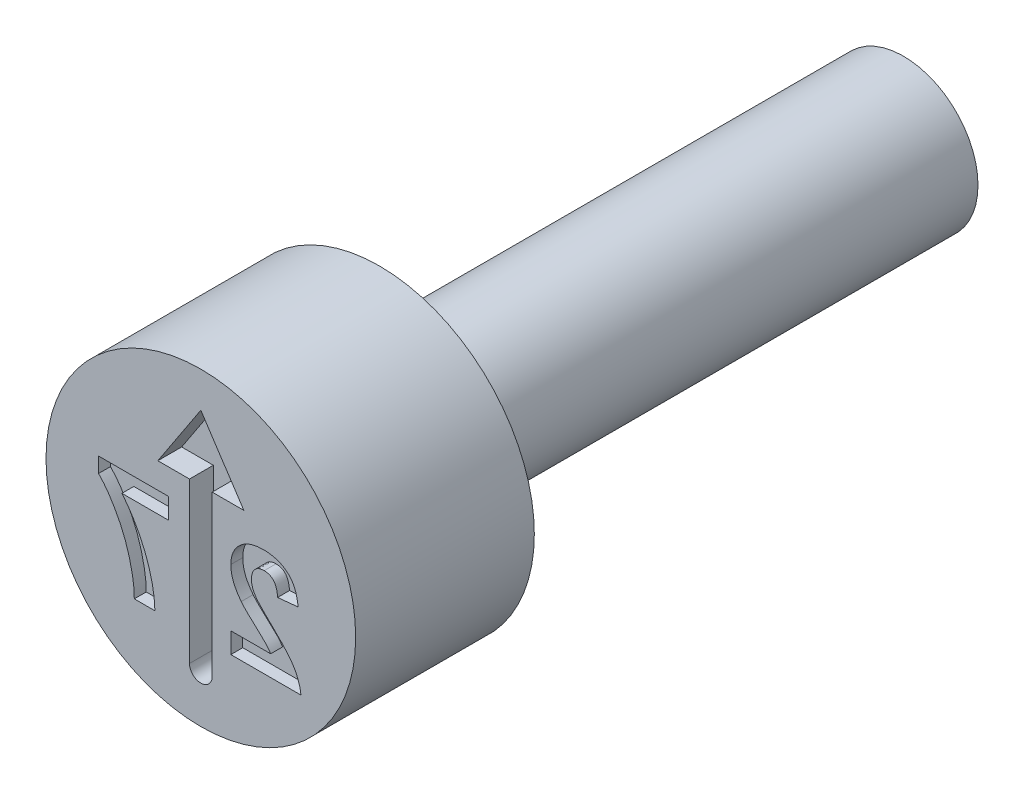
ISO-10303-21;
HEADER;
FILE_DESCRIPTION(('STEP AP214'),'2;1');
FILE_NAME('part.step','',(''),(''),'','','');
FILE_SCHEMA(('AUTOMOTIVE_DESIGN { 1 0 10303 214 1 1 1 1 }'));
ENDSEC;
DATA;
#1=APPLICATION_CONTEXT('core data for automotive mechanical design processes');
#2=APPLICATION_PROTOCOL_DEFINITION('international standard','automotive_design',2000,#1);
#3=PRODUCT_CONTEXT('',#1,'mechanical');
#4=PRODUCT('Part','Part','',(#3));
#5=PRODUCT_RELATED_PRODUCT_CATEGORY('part','',(#4));
#6=PRODUCT_DEFINITION_FORMATION('','',#4);
#7=PRODUCT_DEFINITION_CONTEXT('part definition',#1,'design');
#8=PRODUCT_DEFINITION('design','',#6,#7);
#9=PRODUCT_DEFINITION_SHAPE('','',#8);
#10=(LENGTH_UNIT() NAMED_UNIT(*) SI_UNIT(.MILLI.,.METRE.));
#11=(NAMED_UNIT(*) PLANE_ANGLE_UNIT() SI_UNIT($,.RADIAN.));
#12=(NAMED_UNIT(*) SI_UNIT($,.STERADIAN.) SOLID_ANGLE_UNIT());
#13=UNCERTAINTY_MEASURE_WITH_UNIT(LENGTH_MEASURE(1.E-05),#10,'distance_accuracy_value','');
#14=(GEOMETRIC_REPRESENTATION_CONTEXT(3) GLOBAL_UNCERTAINTY_ASSIGNED_CONTEXT((#13)) GLOBAL_UNIT_ASSIGNED_CONTEXT((#10,
#11,#12)) REPRESENTATION_CONTEXT('',''));
#15=CARTESIAN_POINT('',(0.,0.,0.));
#16=DIRECTION('',(0.,0.,1.));
#17=DIRECTION('',(1.,0.,0.));
#18=AXIS2_PLACEMENT_3D('',#15,#16,#17);
#19=CARTESIAN_POINT('',(0.,1.25,-3.));
#20=DIRECTION('',(0.,0.,1.));
#21=DIRECTION('',(1.,0.,0.));
#22=AXIS2_PLACEMENT_3D('',#19,#20,#21);
#23=PLANE('',#22);
#24=CARTESIAN_POINT('',(0.,0.,-3.));
#25=DIRECTION('',(0.,0.,1.));
#26=DIRECTION('',(1.,0.,0.));
#27=AXIS2_PLACEMENT_3D('',#24,#25,#26);
#28=CIRCLE('',#27,2.6);
#29=CARTESIAN_POINT('',(2.6,0.,-3.));
#30=VERTEX_POINT('',#29);
#31=EDGE_CURVE('E11',#30,#30,#28,.T.);
#32=ORIENTED_EDGE('',*,*,#31,.F.);
#33=EDGE_LOOP('',(#32));
#34=FACE_BOUND('',#33,.T.);
#35=CARTESIAN_POINT('',(0.,0.,-3.));
#36=DIRECTION('',(0.,0.,1.));
#37=DIRECTION('',(1.,0.,0.));
#38=AXIS2_PLACEMENT_3D('',#35,#36,#37);
#39=CIRCLE('',#38,1.25);
#40=CARTESIAN_POINT('',(1.25,0.,-3.));
#41=VERTEX_POINT('',#40);
#42=EDGE_CURVE('E462',#41,#41,#39,.T.);
#43=ORIENTED_EDGE('',*,*,#42,.T.);
#44=EDGE_LOOP('',(#43));
#45=FACE_BOUND('',#44,.T.);
#46=ADVANCED_FACE('F39',(#34,#45),#23,.F.);
#47=CARTESIAN_POINT('',(0.,0.,-0.403888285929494));
#48=DIRECTION('',(0.,0.,1.));
#49=DIRECTION('',(1.,0.,0.));
#50=AXIS2_PLACEMENT_3D('',#47,#48,#49);
#51=CYLINDRICAL_SURFACE('',#50,2.6);
#52=CARTESIAN_POINT('',(0.,0.,0.));
#53=DIRECTION('',(0.,0.,1.));
#54=DIRECTION('',(1.,0.,0.));
#55=AXIS2_PLACEMENT_3D('',#52,#53,#54);
#56=CIRCLE('',#55,2.6);
#57=CARTESIAN_POINT('',(2.6,0.,0.));
#58=VERTEX_POINT('',#57);
#59=EDGE_CURVE('E46',#58,#58,#56,.T.);
#60=ORIENTED_EDGE('',*,*,#59,.F.);
#61=EDGE_LOOP('',(#60));
#62=FACE_BOUND('',#61,.T.);
#63=ORIENTED_EDGE('',*,*,#31,.T.);
#64=EDGE_LOOP('',(#63));
#65=FACE_BOUND('',#64,.T.);
#66=ADVANCED_FACE('F484',(#62,#65),#51,.T.);
#67=CARTESIAN_POINT('',(0.,2.6,0.));
#68=DIRECTION('',(0.,0.,-1.));
#69=DIRECTION('',(-1.,0.,0.));
#70=AXIS2_PLACEMENT_3D('',#67,#68,#69);
#71=PLANE('',#70);
#72=DIRECTION('',(0.,1.,0.));
#73=VECTOR('',#72,1.);
#74=CARTESIAN_POINT('',(-0.540233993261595,0.130769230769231,0.));
#75=LINE('',#74,#73);
#76=CARTESIAN_POINT('',(-0.540233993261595,0.130769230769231,0.));
#77=VERTEX_POINT('',#76);
#78=CARTESIAN_POINT('',(-0.540233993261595,0.476923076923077,0.));
#79=VERTEX_POINT('',#78);
#80=EDGE_CURVE('E708',#77,#79,#75,.T.);
#81=ORIENTED_EDGE('',*,*,#80,.F.);
#82=DIRECTION('',(1.,0.,0.));
#83=VECTOR('',#82,1.);
#84=CARTESIAN_POINT('',(-1.32520995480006,0.130769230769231,0.));
#85=LINE('',#84,#83);
#86=CARTESIAN_POINT('',(-1.32520995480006,0.130769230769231,0.));
#87=VERTEX_POINT('',#86);
#88=EDGE_CURVE('E53',#87,#77,#85,.T.);
#89=ORIENTED_EDGE('',*,*,#88,.F.);
#90=CARTESIAN_POINT('',(-0.771003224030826,-1.3,0.));
#91=CARTESIAN_POINT('',(-0.772160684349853,-1.26933483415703,0.));
#92=CARTESIAN_POINT('',(-0.774488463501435,-1.20766383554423,0.));
#93=CARTESIAN_POINT('',(-0.783197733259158,-1.11509767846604,0.));
#94=CARTESIAN_POINT('',(-0.796876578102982,-1.02218684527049,0.));
#95=CARTESIAN_POINT('',(-0.813866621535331,-0.928716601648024,0.));
#96=CARTESIAN_POINT('',(-0.836297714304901,-0.834914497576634,0.));
#97=CARTESIAN_POINT('',(-0.861898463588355,-0.740433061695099,0.));
#98=CARTESIAN_POINT('',(-0.892909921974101,-0.645776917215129,0.));
#99=CARTESIAN_POINT('',(-0.927672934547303,-0.551127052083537,0.));
#100=CARTESIAN_POINT('',(-0.966049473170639,-0.457382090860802,0.));
#101=CARTESIAN_POINT('',(-1.00787450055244,-0.365704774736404,0.));
#102=CARTESIAN_POINT('',(-1.05303989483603,-0.276667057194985,0.));
#103=CARTESIAN_POINT('',(-1.1009582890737,-0.189956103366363,0.));
#104=CARTESIAN_POINT('',(-1.15218714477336,-0.105850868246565,0.));
#105=CARTESIAN_POINT('',(-1.20676503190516,-0.0244426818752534,0.));
#106=CARTESIAN_POINT('',(-1.26391777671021,0.054857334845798,0.));
#107=CARTESIAN_POINT('',(-1.30478267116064,0.105469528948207,0.));
#108=CARTESIAN_POINT('',(-1.32520995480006,0.130769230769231,0.));
#109=B_SPLINE_CURVE_WITH_KNOTS('',3,(#90,#91,#92,#93,#94,#95,#96,#97,#98,#99,#100,#101,#102,
#103,#104,#105,#106,#107,#108),.UNSPECIFIED.,.F.,.F.,(4,1,1,1,1,1,1,1,1,1,1,1,1,1,1,1,4),(0.,
0.0589531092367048,0.118561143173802,0.178522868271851,0.239353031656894,0.301026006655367,
0.363773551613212,0.427382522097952,0.492333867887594,0.557475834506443,0.621960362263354,
0.685889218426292,0.749254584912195,0.812267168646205,0.875035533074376,0.937533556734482,1.),.UNSPECIFIED.);
#110=CARTESIAN_POINT('',(-0.771003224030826,-1.3,0.));
#111=VERTEX_POINT('',#110);
#112=EDGE_CURVE('E238',#111,#87,#109,.T.);
#113=ORIENTED_EDGE('',*,*,#112,.F.);
#114=DIRECTION('',(1.,0.,0.));
#115=VECTOR('',#114,1.);
#116=CARTESIAN_POINT('',(-1.11715707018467,-1.3,0.));
#117=LINE('',#116,#115);
#118=CARTESIAN_POINT('',(-1.11715707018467,-1.3,0.));
#119=VERTEX_POINT('',#118);
#120=EDGE_CURVE('E241',#119,#111,#117,.T.);
#121=ORIENTED_EDGE('',*,*,#120,.F.);
#122=CARTESIAN_POINT('',(-1.71715707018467,0.223076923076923,0.));
#123=CARTESIAN_POINT('',(-1.70487954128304,0.210584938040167,0.));
#124=CARTESIAN_POINT('',(-1.6796404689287,0.184905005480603,0.));
#125=CARTESIAN_POINT('',(-1.64348796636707,0.142877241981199,0.));
#126=CARTESIAN_POINT('',(-1.60679981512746,0.0972697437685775,0.));
#127=CARTESIAN_POINT('',(-1.5703432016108,0.0474679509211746,0.));
#128=CARTESIAN_POINT('',(-1.5329848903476,-0.00574143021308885,0.));
#129=CARTESIAN_POINT('',(-1.49636664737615,-0.0633783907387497,0.));
#130=CARTESIAN_POINT('',(-1.45922755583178,-0.124695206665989,0.));
#131=CARTESIAN_POINT('',(-1.40922659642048,-0.211427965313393,0.));
#132=CARTESIAN_POINT('',(-1.35078171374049,-0.324727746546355,0.));
#133=CARTESIAN_POINT('',(-1.28895011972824,-0.465565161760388,0.));
#134=CARTESIAN_POINT('',(-1.23627243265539,-0.610727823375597,0.));
#135=CARTESIAN_POINT('',(-1.20020106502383,-0.734417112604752,0.));
#136=CARTESIAN_POINT('',(-1.1758290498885,-0.833553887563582,0.));
#137=CARTESIAN_POINT('',(-1.15990555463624,-0.90604504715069,0.));
#138=CARTESIAN_POINT('',(-1.14650135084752,-0.97649621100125,0.));
#139=CARTESIAN_POINT('',(-1.13559704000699,-1.04503119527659,0.));
#140=CARTESIAN_POINT('',(-1.12745884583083,-1.11168126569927,0.));
#141=CARTESIAN_POINT('',(-1.12102828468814,-1.17621470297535,0.));
#142=CARTESIAN_POINT('',(-1.11785571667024,-1.23878887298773,0.));
#143=CARTESIAN_POINT('',(-1.11738757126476,-1.27980490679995,0.));
#144=CARTESIAN_POINT('',(-1.11715707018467,-1.3,0.));
#145=B_SPLINE_CURVE_WITH_KNOTS('',3,(#122,#123,#124,#125,#126,#127,#128,#129,#130,#131,#132,
#133,#134,#135,#136,#137,#138,#139,#140,#141,#142,#143,#144),.UNSPECIFIED.,.F.,.F.,(4,1,1,1,1,1,
1,1,1,1,1,1,1,1,1,1,1,1,1,1,4),(0.,0.0314272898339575,0.0646054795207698,0.0994393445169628,
0.136456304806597,0.175351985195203,0.216100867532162,0.258977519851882,0.304007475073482,
0.395756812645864,0.487615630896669,0.579873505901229,0.672707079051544,0.718694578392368,
0.76307923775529,0.80589344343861,0.847386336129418,0.88760014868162,0.926386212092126,
0.963754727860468,1.),.UNSPECIFIED.);
#146=CARTESIAN_POINT('',(-1.71715707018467,0.223076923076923,0.));
#147=VERTEX_POINT('',#146);
#148=EDGE_CURVE('E694',#147,#119,#145,.T.);
#149=ORIENTED_EDGE('',*,*,#148,.F.);
#150=DIRECTION('',(0.,-1.,0.));
#151=VECTOR('',#150,1.);
#152=CARTESIAN_POINT('',(-1.71715707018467,0.476923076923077,0.));
#153=LINE('',#152,#151);
#154=CARTESIAN_POINT('',(-1.71715707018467,0.476923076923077,0.));
#155=VERTEX_POINT('',#154);
#156=EDGE_CURVE('E699',#155,#147,#153,.T.);
#157=ORIENTED_EDGE('',*,*,#156,.F.);
#158=DIRECTION('',(-1.,0.,0.));
#159=VECTOR('',#158,1.);
#160=CARTESIAN_POINT('',(-0.540233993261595,0.476923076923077,0.));
#161=LINE('',#160,#159);
#162=EDGE_CURVE('E705',#79,#155,#161,.T.);
#163=ORIENTED_EDGE('',*,*,#162,.F.);
#164=EDGE_LOOP('',(#81,#89,#113,#121,#149,#157,#163));
#165=FACE_BOUND('',#164,.T.);
#166=DIRECTION('',(0.,-1.,0.));
#167=VECTOR('',#166,1.);
#168=CARTESIAN_POINT('',(0.503766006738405,-0.953846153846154,0.));
#169=LINE('',#168,#167);
#170=CARTESIAN_POINT('',(0.503766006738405,-0.953846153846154,0.));
#171=VERTEX_POINT('',#170);
#172=CARTESIAN_POINT('',(0.503766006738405,-1.3,0.));
#173=VERTEX_POINT('',#172);
#174=EDGE_CURVE('E310',#171,#173,#169,.T.);
#175=ORIENTED_EDGE('',*,*,#174,.F.);
#176=DIRECTION('',(-1.,0.,0.));
#177=VECTOR('',#176,1.);
#178=CARTESIAN_POINT('',(1.1726361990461,-0.953846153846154,0.));
#179=LINE('',#178,#177);
#180=CARTESIAN_POINT('',(1.1726361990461,-0.953846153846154,0.));
#181=VERTEX_POINT('',#180);
#182=EDGE_CURVE('E61',#181,#171,#179,.T.);
#183=ORIENTED_EDGE('',*,*,#182,.F.);
#184=CARTESIAN_POINT('',(0.678285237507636,-0.441105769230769,0.));
#185=CARTESIAN_POINT('',(0.683760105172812,-0.448001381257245,0.));
#186=CARTESIAN_POINT('',(0.695486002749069,-0.462770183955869,0.));
#187=CARTESIAN_POINT('',(0.715434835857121,-0.485415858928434,0.));
#188=CARTESIAN_POINT('',(0.738553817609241,-0.510152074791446,0.));
#189=CARTESIAN_POINT('',(0.764516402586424,-0.537441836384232,0.));
#190=CARTESIAN_POINT('',(0.794180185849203,-0.566318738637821,0.));
#191=CARTESIAN_POINT('',(0.826477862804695,-0.597990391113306,0.));
#192=CARTESIAN_POINT('',(0.86283062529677,-0.63083668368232,0.));
#193=CARTESIAN_POINT('',(0.900483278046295,-0.665676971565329,0.));
#194=CARTESIAN_POINT('',(0.938299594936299,-0.699586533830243,0.));
#195=CARTESIAN_POINT('',(0.973058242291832,-0.731793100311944,0.));
#196=CARTESIAN_POINT('',(1.00463065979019,-0.760288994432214,0.));
#197=CARTESIAN_POINT('',(1.03154646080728,-0.786647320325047,0.));
#198=CARTESIAN_POINT('',(1.05538882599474,-0.809069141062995,0.));
#199=CARTESIAN_POINT('',(1.07529839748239,-0.828704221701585,0.));
#200=CARTESIAN_POINT('',(1.09164773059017,-0.845077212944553,0.));
#201=CARTESIAN_POINT('',(1.11417605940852,-0.870598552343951,0.));
#202=CARTESIAN_POINT('',(1.14284080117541,-0.905116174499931,0.));
#203=CARTESIAN_POINT('',(1.16300761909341,-0.938098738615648,0.));
#204=CARTESIAN_POINT('',(1.1726361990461,-0.953846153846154,0.));
#205=B_SPLINE_CURVE_WITH_KNOTS('',3,(#184,#185,#186,#187,#188,#189,#190,#191,#192,#193,#194,
#195,#196,#197,#198,#199,#200,#201,#202,#203,#204),.UNSPECIFIED.,.F.,.F.,(4,1,1,1,1,1,1,1,1,1,1,
1,1,1,1,1,1,1,4),(0.,0.0369753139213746,0.0791925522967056,0.126700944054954,0.17918407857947,
0.23736864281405,0.300558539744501,0.369153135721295,0.443112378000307,0.516018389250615,
0.582473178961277,0.642136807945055,0.694619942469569,0.740679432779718,0.779589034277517,
0.812073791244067,0.837814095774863,0.922564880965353,1.),.UNSPECIFIED.);
#206=CARTESIAN_POINT('',(0.678285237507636,-0.441105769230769,0.));
#207=VERTEX_POINT('',#206);
#208=EDGE_CURVE('E381',#207,#181,#205,.T.);
#209=ORIENTED_EDGE('',*,*,#208,.F.);
#210=CARTESIAN_POINT('',(0.503766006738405,0.0103365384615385,0.));
#211=CARTESIAN_POINT('',(0.504206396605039,-0.00928428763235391,0.));
#212=CARTESIAN_POINT('',(0.505080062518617,-0.0482089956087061,0.));
#213=CARTESIAN_POINT('',(0.513444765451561,-0.105751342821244,0.));
#214=CARTESIAN_POINT('',(0.526224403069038,-0.161966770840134,0.));
#215=CARTESIAN_POINT('',(0.54511170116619,-0.21699266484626,0.));
#216=CARTESIAN_POINT('',(0.569052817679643,-0.272148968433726,0.));
#217=CARTESIAN_POINT('',(0.599913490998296,-0.327559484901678,0.));
#218=CARTESIAN_POINT('',(0.635745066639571,-0.384895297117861,0.));
#219=CARTESIAN_POINT('',(0.663799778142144,-0.421965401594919,0.));
#220=CARTESIAN_POINT('',(0.678285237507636,-0.441105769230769,0.));
#221=B_SPLINE_CURVE_WITH_KNOTS('',3,(#210,#211,#212,#213,#214,#215,#216,#217,#218,#219,#220),
.UNSPECIFIED.,.F.,.F.,(4,1,1,1,1,1,1,1,4),(0.,0.119176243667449,0.236427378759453,
0.352663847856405,0.469086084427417,0.589462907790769,0.717601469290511,0.854189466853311,1.),.UNSPECIFIED.);
#222=CARTESIAN_POINT('',(0.503766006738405,0.0103365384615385,0.));
#223=VERTEX_POINT('',#222);
#224=EDGE_CURVE('E373',#223,#207,#221,.T.);
#225=ORIENTED_EDGE('',*,*,#224,.F.);
#226=CARTESIAN_POINT('',(1.05616985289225,0.5,0.));
#227=CARTESIAN_POINT('',(1.03524090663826,0.499597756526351,0.));
#228=CARTESIAN_POINT('',(0.994479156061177,0.498814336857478,0.));
#229=CARTESIAN_POINT('',(0.934974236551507,0.492344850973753,0.));
#230=CARTESIAN_POINT('',(0.879073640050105,0.481064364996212,0.));
#231=CARTESIAN_POINT('',(0.826288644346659,0.466121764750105,0.));
#232=CARTESIAN_POINT('',(0.777161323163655,0.446172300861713,0.));
#233=CARTESIAN_POINT('',(0.731282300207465,0.422054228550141,0.));
#234=CARTESIAN_POINT('',(0.689373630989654,0.392852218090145,0.));
#235=CARTESIAN_POINT('',(0.650810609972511,0.360158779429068,0.));
#236=CARTESIAN_POINT('',(0.616338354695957,0.32420659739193,0.));
#237=CARTESIAN_POINT('',(0.58614377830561,0.285857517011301,0.));
#238=CARTESIAN_POINT('',(0.56084686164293,0.245138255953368,0.));
#239=CARTESIAN_POINT('',(0.539618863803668,0.202545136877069,0.));
#240=CARTESIAN_POINT('',(0.523857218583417,0.157392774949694,0.));
#241=CARTESIAN_POINT('',(0.512372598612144,0.110305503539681,0.));
#242=CARTESIAN_POINT('',(0.504757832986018,0.0610636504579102,0.));
#243=CARTESIAN_POINT('',(0.504100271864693,0.0274325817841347,0.));
#244=CARTESIAN_POINT('',(0.503766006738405,0.0103365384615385,0.));
#245=B_SPLINE_CURVE_WITH_KNOTS('',3,(#226,#227,#228,#229,#230,#231,#232,#233,#234,#235,#236,
#237,#238,#239,#240,#241,#242,#243,#244),.UNSPECIFIED.,.F.,.F.,(4,1,1,1,1,1,1,1,1,1,1,1,1,1,1,1,
4),(0.,0.0756723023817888,0.147381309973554,0.216084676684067,0.28169803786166,
0.345459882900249,0.407485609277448,0.46873129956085,0.529782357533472,0.590032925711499,
0.648548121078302,0.70595351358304,0.763101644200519,0.820289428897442,0.878479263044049,
0.938226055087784,1.),.UNSPECIFIED.);
#246=CARTESIAN_POINT('',(1.05616985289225,0.5,0.));
#247=VERTEX_POINT('',#246);
#248=EDGE_CURVE('E365',#247,#223,#245,.T.);
#249=ORIENTED_EDGE('',*,*,#248,.F.);
#250=CARTESIAN_POINT('',(1.63453523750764,-0.0430288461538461,0.));
#251=CARTESIAN_POINT('',(1.63175221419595,-0.019659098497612,0.));
#252=CARTESIAN_POINT('',(1.62635637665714,0.025651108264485,0.));
#253=CARTESIAN_POINT('',(1.61289097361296,0.0907321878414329,0.));
#254=CARTESIAN_POINT('',(1.59583753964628,0.150772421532,0.));
#255=CARTESIAN_POINT('',(1.57438308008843,0.205660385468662,0.));
#256=CARTESIAN_POINT('',(1.54941433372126,0.255745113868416,0.));
#257=CARTESIAN_POINT('',(1.51965768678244,0.30027505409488,0.));
#258=CARTESIAN_POINT('',(1.48615286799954,0.339743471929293,0.));
#259=CARTESIAN_POINT('',(1.44887092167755,0.374129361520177,0.));
#260=CARTESIAN_POINT('',(1.4080488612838,0.403542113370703,0.));
#261=CARTESIAN_POINT('',(1.36521343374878,0.429797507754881,0.));
#262=CARTESIAN_POINT('',(1.31952751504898,0.451335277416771,0.));
#263=CARTESIAN_POINT('',(1.27149410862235,0.469085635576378,0.));
#264=CARTESIAN_POINT('',(1.22113492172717,0.483271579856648,0.));
#265=CARTESIAN_POINT('',(1.16821703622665,0.492651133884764,0.));
#266=CARTESIAN_POINT('',(1.11306704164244,0.49924874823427,0.));
#267=CARTESIAN_POINT('',(1.07542142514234,0.499745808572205,0.));
#268=CARTESIAN_POINT('',(1.05616985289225,0.5,0.));
#269=B_SPLINE_CURVE_WITH_KNOTS('',3,(#250,#251,#252,#253,#254,#255,#256,#257,#258,#259,#260,
#261,#262,#263,#264,#265,#266,#267,#268),.UNSPECIFIED.,.F.,.F.,(4,1,1,1,1,1,1,1,1,1,1,1,1,1,1,1,
4),(0.,0.0794357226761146,0.154013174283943,0.224141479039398,0.289934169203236,
0.352732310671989,0.41272577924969,0.470302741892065,0.527168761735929,0.583502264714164,
0.639948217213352,0.696584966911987,0.753726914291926,0.812707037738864,0.872963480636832,
0.93503486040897,1.),.UNSPECIFIED.);
#270=CARTESIAN_POINT('',(1.63453523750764,-0.0430288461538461,0.));
#271=VERTEX_POINT('',#270);
#272=EDGE_CURVE('E360',#271,#247,#269,.T.);
#273=ORIENTED_EDGE('',*,*,#272,.F.);
#274=DIRECTION('',(0.995240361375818,0.097450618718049,0.));
#275=VECTOR('',#274,1.);
#276=CARTESIAN_POINT('',(1.28838139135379,-0.0769230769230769,0.));
#277=LINE('',#276,#275);
#278=CARTESIAN_POINT('',(1.28838139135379,-0.0769230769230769,0.));
#279=VERTEX_POINT('',#278);
#280=EDGE_CURVE('E354',#279,#271,#277,.T.);
#281=ORIENTED_EDGE('',*,*,#280,.F.);
#282=CARTESIAN_POINT('',(1.06338139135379,0.2,0.));
#283=CARTESIAN_POINT('',(1.07908141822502,0.199288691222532,0.));
#284=CARTESIAN_POINT('',(1.10941048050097,0.197914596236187,0.));
#285=CARTESIAN_POINT('',(1.1525146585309,0.18591069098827,0.));
#286=CARTESIAN_POINT('',(1.19022285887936,0.165130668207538,0.));
#287=CARTESIAN_POINT('',(1.21709572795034,0.141449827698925,0.));
#288=CARTESIAN_POINT('',(1.23524962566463,0.118421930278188,0.));
#289=CARTESIAN_POINT('',(1.24761905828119,0.0983546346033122,0.));
#290=CARTESIAN_POINT('',(1.25828054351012,0.0755520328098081,0.));
#291=CARTESIAN_POINT('',(1.26772750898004,0.0502708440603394,0.));
#292=CARTESIAN_POINT('',(1.27518954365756,0.0222214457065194,0.));
#293=CARTESIAN_POINT('',(1.2811990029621,-0.00838253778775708,0.));
#294=CARTESIAN_POINT('',(1.2860417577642,-0.0417057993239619,0.));
#295=CARTESIAN_POINT('',(1.28758183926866,-0.0648878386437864,0.));
#296=CARTESIAN_POINT('',(1.28838139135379,-0.0769230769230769,0.));
#297=B_SPLINE_CURVE_WITH_KNOTS('',3,(#282,#283,#284,#285,#286,#287,#288,#289,#290,#291,#292,
#293,#294,#295,#296),.UNSPECIFIED.,.F.,.F.,(4,1,1,1,1,1,1,1,1,1,1,1,4),(0.,0.116899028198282,
0.225823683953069,0.330086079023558,0.435451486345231,0.490306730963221,0.548244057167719,
0.610766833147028,0.677675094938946,0.749188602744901,0.826858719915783,0.910111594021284,1.),.UNSPECIFIED.);
#298=CARTESIAN_POINT('',(1.06338139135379,0.2,0.));
#299=VERTEX_POINT('',#298);
#300=EDGE_CURVE('E346',#299,#279,#297,.T.);
#301=ORIENTED_EDGE('',*,*,#300,.F.);
#302=CARTESIAN_POINT('',(0.849919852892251,-0.0361778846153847,0.));
#303=CARTESIAN_POINT('',(0.850568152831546,-0.0182186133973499,0.));
#304=CARTESIAN_POINT('',(0.85179468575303,0.0157589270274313,0.));
#305=CARTESIAN_POINT('',(0.862079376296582,0.063707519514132,0.));
#306=CARTESIAN_POINT('',(0.88031760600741,0.104926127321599,0.));
#307=CARTESIAN_POINT('',(0.905428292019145,0.139541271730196,0.));
#308=CARTESIAN_POINT('',(0.937180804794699,0.166662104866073,0.));
#309=CARTESIAN_POINT('',(0.974300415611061,0.186701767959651,0.));
#310=CARTESIAN_POINT('',(1.0173304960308,0.197781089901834,0.));
#311=CARTESIAN_POINT('',(1.04757457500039,0.1992383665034,0.));
#312=CARTESIAN_POINT('',(1.06338139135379,0.2,0.));
#313=B_SPLINE_CURVE_WITH_KNOTS('',3,(#302,#303,#304,#305,#306,#307,#308,#309,#310,#311,#312),
.UNSPECIFIED.,.F.,.F.,(4,1,1,1,1,1,1,1,4),(0.,0.149140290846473,0.282161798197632,
0.404655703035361,0.521109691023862,0.634416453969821,0.748796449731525,0.868710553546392,1.),.UNSPECIFIED.);
#314=CARTESIAN_POINT('',(0.849919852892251,-0.0361778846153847,0.));
#315=VERTEX_POINT('',#314);
#316=EDGE_CURVE('E338',#315,#299,#313,.T.);
#317=ORIENTED_EDGE('',*,*,#316,.F.);
#318=CARTESIAN_POINT('',(0.918429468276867,-0.244230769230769,0.));
#319=CARTESIAN_POINT('',(0.908007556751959,-0.226918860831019,0.));
#320=CARTESIAN_POINT('',(0.887904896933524,-0.193526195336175,0.));
#321=CARTESIAN_POINT('',(0.865860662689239,-0.141015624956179,0.));
#322=CARTESIAN_POINT('',(0.852628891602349,-0.0885159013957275,0.));
#323=CARTESIAN_POINT('',(0.850813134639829,-0.0534358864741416,0.));
#324=CARTESIAN_POINT('',(0.849919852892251,-0.0361778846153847,0.));
#325=B_SPLINE_CURVE_WITH_KNOTS('',3,(#318,#319,#320,#321,#322,#323,#324),.UNSPECIFIED.,.F.,.F.,
(4,1,1,1,4),(0.,0.272795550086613,0.526191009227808,0.766904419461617,1.),.UNSPECIFIED.);
#326=CARTESIAN_POINT('',(0.918429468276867,-0.244230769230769,0.));
#327=VERTEX_POINT('',#326);
#328=EDGE_CURVE('E330',#327,#315,#325,.T.);
#329=ORIENTED_EDGE('',*,*,#328,.F.);
#330=CARTESIAN_POINT('',(1.19391023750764,-0.534855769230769,0.));
#331=CARTESIAN_POINT('',(1.17611358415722,-0.517677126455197,0.));
#332=CARTESIAN_POINT('',(1.14223399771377,-0.484974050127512,0.));
#333=CARTESIAN_POINT('',(1.09398940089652,-0.438144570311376,0.));
#334=CARTESIAN_POINT('',(1.05157742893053,-0.395094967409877,0.));
#335=CARTESIAN_POINT('',(1.01411130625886,-0.356940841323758,0.));
#336=CARTESIAN_POINT('',(0.982456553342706,-0.322710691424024,0.));
#337=CARTESIAN_POINT('',(0.95619678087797,-0.292942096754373,0.));
#338=CARTESIAN_POINT('',(0.93499941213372,-0.267513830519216,0.));
#339=CARTESIAN_POINT('',(0.923518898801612,-0.251382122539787,0.));
#340=CARTESIAN_POINT('',(0.918429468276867,-0.244230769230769,0.));
#341=B_SPLINE_CURVE_WITH_KNOTS('',3,(#330,#331,#332,#333,#334,#335,#336,#337,#338,#339,#340),
.UNSPECIFIED.,.F.,.F.,(4,1,1,1,1,1,1,1,4),(0.,0.185090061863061,0.352356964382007,
0.503079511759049,0.637279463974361,0.752473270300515,0.851885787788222,0.934339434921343,1.),.UNSPECIFIED.);
#342=CARTESIAN_POINT('',(1.19391023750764,-0.534855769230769,0.));
#343=VERTEX_POINT('',#342);
#344=EDGE_CURVE('E322',#343,#327,#341,.T.);
#345=ORIENTED_EDGE('',*,*,#344,.F.);
#346=CARTESIAN_POINT('',(1.68068908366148,-1.3,0.));
#347=CARTESIAN_POINT('',(1.67670429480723,-1.27041613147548,0.));
#348=CARTESIAN_POINT('',(1.66873695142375,-1.21126498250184,0.));
#349=CARTESIAN_POINT('',(1.6441047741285,-1.12486004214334,0.));
#350=CARTESIAN_POINT('',(1.61122925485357,-1.04054358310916,0.));
#351=CARTESIAN_POINT('',(1.57554912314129,-0.971930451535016,0.));
#352=CARTESIAN_POINT('',(1.54006128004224,-0.916699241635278,0.));
#353=CARTESIAN_POINT('',(1.50786315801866,-0.871442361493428,0.));
#354=CARTESIAN_POINT('',(1.46945198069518,-0.823290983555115,0.));
#355=CARTESIAN_POINT('',(1.42538513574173,-0.77185639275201,0.));
#356=CARTESIAN_POINT('',(1.3759061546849,-0.71697780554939,0.));
#357=CARTESIAN_POINT('',(1.32064589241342,-0.658859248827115,0.));
#358=CARTESIAN_POINT('',(1.25934074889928,-0.597778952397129,0.));
#359=CARTESIAN_POINT('',(1.21621148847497,-0.556302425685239,0.));
#360=CARTESIAN_POINT('',(1.19391023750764,-0.534855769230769,0.));
#361=B_SPLINE_CURVE_WITH_KNOTS('',3,(#346,#347,#348,#349,#350,#351,#352,#353,#354,#355,#356,
#357,#358,#359,#360),.UNSPECIFIED.,.F.,.F.,(4,1,1,1,1,1,1,1,1,1,1,1,4),(0.,0.0963574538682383,
0.192660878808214,0.289454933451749,0.388479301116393,0.441921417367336,0.501521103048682,
0.567882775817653,0.640891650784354,0.72037065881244,0.806636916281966,0.900015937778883,1.),.UNSPECIFIED.);
#362=CARTESIAN_POINT('',(1.68068908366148,-1.3,0.));
#363=VERTEX_POINT('',#362);
#364=EDGE_CURVE('E317',#363,#343,#361,.T.);
#365=ORIENTED_EDGE('',*,*,#364,.F.);
#366=DIRECTION('',(1.,0.,0.));
#367=VECTOR('',#366,1.);
#368=CARTESIAN_POINT('',(0.503766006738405,-1.3,0.));
#369=LINE('',#368,#367);
#370=EDGE_CURVE('E314',#173,#363,#369,.T.);
#371=ORIENTED_EDGE('',*,*,#370,.F.);
#372=EDGE_LOOP('',(#175,#183,#209,#225,#249,#273,#281,#301,#317,#329,#345,#365,#371));
#373=FACE_BOUND('',#372,.T.);
#374=DIRECTION('',(0.,1.,0.));
#375=VECTOR('',#374,1.);
#376=CARTESIAN_POINT('',(0.190473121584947,0.906351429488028,0.));
#377=LINE('',#376,#375);
#378=CARTESIAN_POINT('',(0.190473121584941,-1.77616183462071,0.));
#379=VERTEX_POINT('',#378);
#380=CARTESIAN_POINT('',(0.190473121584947,0.906351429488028,0.));
#381=VERTEX_POINT('',#380);
#382=EDGE_CURVE('E443',#379,#381,#377,.T.);
#383=ORIENTED_EDGE('',*,*,#382,.F.);
#384=CARTESIAN_POINT('',(1.6342449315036E-13,-1.77616183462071,0.));
#385=DIRECTION('',(0.,0.,1.));
#386=DIRECTION('',(1.,0.,0.));
#387=AXIS2_PLACEMENT_3D('',#384,#385,#386);
#388=CIRCLE('',#387,0.190473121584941);
#389=CARTESIAN_POINT('',(-0.190473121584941,-1.77616183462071,0.));
#390=VERTEX_POINT('',#389);
#391=EDGE_CURVE('E395',#390,#379,#388,.T.);
#392=ORIENTED_EDGE('',*,*,#391,.F.);
#393=DIRECTION('',(0.,-1.,0.));
#394=VECTOR('',#393,1.);
#395=CARTESIAN_POINT('',(-0.190473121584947,0.906351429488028,0.));
#396=LINE('',#395,#394);
#397=CARTESIAN_POINT('',(-0.190473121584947,0.906351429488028,0.));
#398=VERTEX_POINT('',#397);
#399=EDGE_CURVE('E423',#398,#390,#396,.T.);
#400=ORIENTED_EDGE('',*,*,#399,.F.);
#401=DIRECTION('',(1.,0.,0.));
#402=VECTOR('',#401,1.);
#403=CARTESIAN_POINT('',(-0.721917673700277,0.906351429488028,0.));
#404=LINE('',#403,#402);
#405=CARTESIAN_POINT('',(-0.721917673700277,0.906351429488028,0.));
#406=VERTEX_POINT('',#405);
#407=EDGE_CURVE('E455',#406,#398,#404,.T.);
#408=ORIENTED_EDGE('',*,*,#407,.F.);
#409=DIRECTION('',(-0.550159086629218,-0.835059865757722,0.));
#410=VECTOR('',#409,1.);
#411=CARTESIAN_POINT('',(0.,2.00211534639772,0.));
#412=LINE('',#411,#410);
#413=CARTESIAN_POINT('',(0.,2.00211534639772,0.));
#414=VERTEX_POINT('',#413);
#415=EDGE_CURVE('E452',#414,#406,#412,.T.);
#416=ORIENTED_EDGE('',*,*,#415,.F.);
#417=DIRECTION('',(-0.550159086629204,0.835059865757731,0.));
#418=VECTOR('',#417,1.);
#419=CARTESIAN_POINT('',(0.,2.00211534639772,0.));
#420=LINE('',#419,#418);
#421=CARTESIAN_POINT('',(0.721917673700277,0.906351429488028,0.));
#422=VERTEX_POINT('',#421);
#423=EDGE_CURVE('E449',#422,#414,#420,.T.);
#424=ORIENTED_EDGE('',*,*,#423,.F.);
#425=DIRECTION('',(1.,0.,0.));
#426=VECTOR('',#425,1.);
#427=CARTESIAN_POINT('',(0.721917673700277,0.906351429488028,0.));
#428=LINE('',#427,#426);
#429=EDGE_CURVE('E446',#381,#422,#428,.T.);
#430=ORIENTED_EDGE('',*,*,#429,.F.);
#431=EDGE_LOOP('',(#383,#392,#400,#408,#416,#424,#430));
#432=FACE_BOUND('',#431,.T.);
#433=ORIENTED_EDGE('',*,*,#59,.T.);
#434=EDGE_LOOP('',(#433));
#435=FACE_BOUND('',#434,.T.);
#436=ADVANCED_FACE('F482',(#165,#373,#432,#435),#71,.F.);
#437=CARTESIAN_POINT('',(0.,0.,-11.8));
#438=DIRECTION('',(0.,0.,1.));
#439=DIRECTION('',(1.,0.,0.));
#440=AXIS2_PLACEMENT_3D('',#437,#438,#439);
#441=PLANE('',#440);
#442=CARTESIAN_POINT('',(0.,0.,-11.8));
#443=DIRECTION('',(0.,0.,1.));
#444=DIRECTION('',(1.,0.,0.));
#445=AXIS2_PLACEMENT_3D('',#442,#443,#444);
#446=CIRCLE('',#445,1.25);
#447=CARTESIAN_POINT('',(1.25,0.,-11.8));
#448=VERTEX_POINT('',#447);
#449=EDGE_CURVE('E477',#448,#448,#446,.T.);
#450=ORIENTED_EDGE('',*,*,#449,.F.);
#451=EDGE_LOOP('',(#450));
#452=FACE_BOUND('',#451,.T.);
#453=ADVANCED_FACE('F497',(#452),#441,.F.);
#454=CARTESIAN_POINT('',(0.,0.,-0.403888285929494));
#455=DIRECTION('',(0.,0.,1.));
#456=DIRECTION('',(1.,0.,0.));
#457=AXIS2_PLACEMENT_3D('',#454,#455,#456);
#458=CYLINDRICAL_SURFACE('',#457,1.25);
#459=ORIENTED_EDGE('',*,*,#42,.F.);
#460=EDGE_LOOP('',(#459));
#461=FACE_BOUND('',#460,.T.);
#462=ORIENTED_EDGE('',*,*,#449,.T.);
#463=EDGE_LOOP('',(#462));
#464=FACE_BOUND('',#463,.T.);
#465=ADVANCED_FACE('F493',(#461,#464),#458,.T.);
#466=CARTESIAN_POINT('',(1.6342449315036E-13,-1.77616183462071,-0.4));
#467=DIRECTION('',(0.,0.,1.));
#468=DIRECTION('',(1.,0.,0.));
#469=AXIS2_PLACEMENT_3D('',#466,#467,#468);
#470=CYLINDRICAL_SURFACE('',#469,0.190473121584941);
#471=ORIENTED_EDGE('',*,*,#391,.T.);
#472=DIRECTION('',(0.,0.,1.));
#473=VECTOR('',#472,1.);
#474=CARTESIAN_POINT('',(0.190473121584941,-1.77616183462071,-0.4));
#475=LINE('',#474,#473);
#476=CARTESIAN_POINT('',(0.190473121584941,-1.77616183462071,-0.4));
#477=VERTEX_POINT('',#476);
#478=EDGE_CURVE('E441',#477,#379,#475,.T.);
#479=ORIENTED_EDGE('',*,*,#478,.F.);
#480=CARTESIAN_POINT('',(1.6342449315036E-13,-1.77616183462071,-0.4));
#481=DIRECTION('',(0.,0.,1.));
#482=DIRECTION('',(1.,0.,0.));
#483=AXIS2_PLACEMENT_3D('',#480,#481,#482);
#484=CIRCLE('',#483,0.190473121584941);
#485=CARTESIAN_POINT('',(-0.190473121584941,-1.77616183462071,-0.4));
#486=VERTEX_POINT('',#485);
#487=EDGE_CURVE('E419',#486,#477,#484,.T.);
#488=ORIENTED_EDGE('',*,*,#487,.F.);
#489=DIRECTION('',(0.,0.,1.));
#490=VECTOR('',#489,1.);
#491=CARTESIAN_POINT('',(-0.190473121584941,-1.77616183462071,-0.4));
#492=LINE('',#491,#490);
#493=EDGE_CURVE('E460',#486,#390,#492,.T.);
#494=ORIENTED_EDGE('',*,*,#493,.T.);
#495=EDGE_LOOP('',(#471,#479,#488,#494));
#496=FACE_BOUND('',#495,.T.);
#497=ADVANCED_FACE('F496',(#496),#470,.F.);
#498=CARTESIAN_POINT('',(-0.190473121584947,0.906351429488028,-0.4));
#499=DIRECTION('',(-1.,0.,0.));
#500=DIRECTION('',(0.,-1.,0.));
#501=AXIS2_PLACEMENT_3D('',#498,#499,#500);
#502=PLANE('',#501);
#503=ORIENTED_EDGE('',*,*,#399,.T.);
#504=ORIENTED_EDGE('',*,*,#493,.F.);
#505=DIRECTION('',(0.,-1.,0.));
#506=VECTOR('',#505,1.);
#507=CARTESIAN_POINT('',(-0.190473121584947,0.906351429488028,-0.4));
#508=LINE('',#507,#506);
#509=CARTESIAN_POINT('',(-0.190473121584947,0.906351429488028,-0.4));
#510=VERTEX_POINT('',#509);
#511=EDGE_CURVE('E438',#510,#486,#508,.T.);
#512=ORIENTED_EDGE('',*,*,#511,.F.);
#513=DIRECTION('',(0.,0.,1.));
#514=VECTOR('',#513,1.);
#515=CARTESIAN_POINT('',(-0.190473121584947,0.906351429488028,-0.4));
#516=LINE('',#515,#514);
#517=EDGE_CURVE('E463',#510,#398,#516,.T.);
#518=ORIENTED_EDGE('',*,*,#517,.T.);
#519=EDGE_LOOP('',(#503,#504,#512,#518));
#520=FACE_BOUND('',#519,.T.);
#521=ADVANCED_FACE('F511',(#520),#502,.F.);
#522=CARTESIAN_POINT('',(-0.721917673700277,0.906351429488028,-0.4));
#523=DIRECTION('',(0.,-1.,0.));
#524=DIRECTION('',(0.,0.,-1.));
#525=AXIS2_PLACEMENT_3D('',#522,#523,#524);
#526=PLANE('',#525);
#527=ORIENTED_EDGE('',*,*,#407,.T.);
#528=ORIENTED_EDGE('',*,*,#517,.F.);
#529=DIRECTION('',(1.,0.,0.));
#530=VECTOR('',#529,1.);
#531=CARTESIAN_POINT('',(-0.721917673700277,0.906351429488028,-0.4));
#532=LINE('',#531,#530);
#533=CARTESIAN_POINT('',(-0.721917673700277,0.906351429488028,-0.4));
#534=VERTEX_POINT('',#533);
#535=EDGE_CURVE('E435',#534,#510,#532,.T.);
#536=ORIENTED_EDGE('',*,*,#535,.F.);
#537=DIRECTION('',(0.,0.,1.));
#538=VECTOR('',#537,1.);
#539=CARTESIAN_POINT('',(-0.721917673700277,0.906351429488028,-0.4));
#540=LINE('',#539,#538);
#541=EDGE_CURVE('E465',#534,#406,#540,.T.);
#542=ORIENTED_EDGE('',*,*,#541,.T.);
#543=EDGE_LOOP('',(#527,#528,#536,#542));
#544=FACE_BOUND('',#543,.T.);
#545=ADVANCED_FACE('F529',(#544),#526,.F.);
#546=CARTESIAN_POINT('',(0.,2.00211534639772,-0.4));
#547=DIRECTION('',(-0.835059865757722,0.550159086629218,0.));
#548=DIRECTION('',(-0.550159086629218,-0.835059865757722,0.));
#549=AXIS2_PLACEMENT_3D('',#546,#547,#548);
#550=PLANE('',#549);
#551=ORIENTED_EDGE('',*,*,#415,.T.);
#552=ORIENTED_EDGE('',*,*,#541,.F.);
#553=DIRECTION('',(-0.550159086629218,-0.835059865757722,0.));
#554=VECTOR('',#553,1.);
#555=CARTESIAN_POINT('',(0.,2.00211534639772,-0.4));
#556=LINE('',#555,#554);
#557=CARTESIAN_POINT('',(0.,2.00211534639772,-0.4));
#558=VERTEX_POINT('',#557);
#559=EDGE_CURVE('E432',#558,#534,#556,.T.);
#560=ORIENTED_EDGE('',*,*,#559,.F.);
#561=DIRECTION('',(0.,0.,1.));
#562=VECTOR('',#561,1.);
#563=CARTESIAN_POINT('',(0.,2.00211534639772,-0.4));
#564=LINE('',#563,#562);
#565=EDGE_CURVE('E467',#558,#414,#564,.T.);
#566=ORIENTED_EDGE('',*,*,#565,.T.);
#567=EDGE_LOOP('',(#551,#552,#560,#566));
#568=FACE_BOUND('',#567,.T.);
#569=ADVANCED_FACE('F525',(#568),#550,.F.);
#570=CARTESIAN_POINT('',(0.,2.00211534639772,-0.4));
#571=DIRECTION('',(0.835059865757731,0.550159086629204,0.));
#572=DIRECTION('',(-0.550159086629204,0.835059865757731,0.));
#573=AXIS2_PLACEMENT_3D('',#570,#571,#572);
#574=PLANE('',#573);
#575=ORIENTED_EDGE('',*,*,#423,.T.);
#576=ORIENTED_EDGE('',*,*,#565,.F.);
#577=DIRECTION('',(-0.550159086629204,0.835059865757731,0.));
#578=VECTOR('',#577,1.);
#579=CARTESIAN_POINT('',(0.,2.00211534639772,-0.4));
#580=LINE('',#579,#578);
#581=CARTESIAN_POINT('',(0.721917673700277,0.906351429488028,-0.4));
#582=VERTEX_POINT('',#581);
#583=EDGE_CURVE('E429',#582,#558,#580,.T.);
#584=ORIENTED_EDGE('',*,*,#583,.F.);
#585=DIRECTION('',(0.,0.,1.));
#586=VECTOR('',#585,1.);
#587=CARTESIAN_POINT('',(0.721917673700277,0.906351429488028,-0.4));
#588=LINE('',#587,#586);
#589=EDGE_CURVE('E469',#582,#422,#588,.T.);
#590=ORIENTED_EDGE('',*,*,#589,.T.);
#591=EDGE_LOOP('',(#575,#576,#584,#590));
#592=FACE_BOUND('',#591,.T.);
#593=ADVANCED_FACE('F521',(#592),#574,.F.);
#594=CARTESIAN_POINT('',(0.721917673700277,0.906351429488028,-0.4));
#595=DIRECTION('',(0.,-1.,0.));
#596=DIRECTION('',(0.,0.,-1.));
#597=AXIS2_PLACEMENT_3D('',#594,#595,#596);
#598=PLANE('',#597);
#599=ORIENTED_EDGE('',*,*,#429,.T.);
#600=ORIENTED_EDGE('',*,*,#589,.F.);
#601=DIRECTION('',(1.,0.,0.));
#602=VECTOR('',#601,1.);
#603=CARTESIAN_POINT('',(0.721917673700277,0.906351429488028,-0.4));
#604=LINE('',#603,#602);
#605=CARTESIAN_POINT('',(0.190473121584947,0.906351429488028,-0.4));
#606=VERTEX_POINT('',#605);
#607=EDGE_CURVE('E426',#606,#582,#604,.T.);
#608=ORIENTED_EDGE('',*,*,#607,.F.);
#609=DIRECTION('',(0.,0.,1.));
#610=VECTOR('',#609,1.);
#611=CARTESIAN_POINT('',(0.190473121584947,0.906351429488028,-0.4));
#612=LINE('',#611,#610);
#613=EDGE_CURVE('E471',#606,#381,#612,.T.);
#614=ORIENTED_EDGE('',*,*,#613,.T.);
#615=EDGE_LOOP('',(#599,#600,#608,#614));
#616=FACE_BOUND('',#615,.T.);
#617=ADVANCED_FACE('F517',(#616),#598,.F.);
#618=CARTESIAN_POINT('',(0.190473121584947,0.906351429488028,-0.4));
#619=DIRECTION('',(1.,0.,0.));
#620=DIRECTION('',(0.,1.,0.));
#621=AXIS2_PLACEMENT_3D('',#618,#619,#620);
#622=PLANE('',#621);
#623=ORIENTED_EDGE('',*,*,#382,.T.);
#624=ORIENTED_EDGE('',*,*,#613,.F.);
#625=DIRECTION('',(0.,1.,0.));
#626=VECTOR('',#625,1.);
#627=CARTESIAN_POINT('',(0.190473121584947,0.906351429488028,-0.4));
#628=LINE('',#627,#626);
#629=EDGE_CURVE('E422',#477,#606,#628,.T.);
#630=ORIENTED_EDGE('',*,*,#629,.F.);
#631=ORIENTED_EDGE('',*,*,#478,.T.);
#632=EDGE_LOOP('',(#623,#624,#630,#631));
#633=FACE_BOUND('',#632,.T.);
#634=ADVANCED_FACE('F513',(#633),#622,.F.);
#635=CARTESIAN_POINT('',(1.6342449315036E-13,-1.77616183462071,-0.4));
#636=DIRECTION('',(0.,0.,1.));
#637=DIRECTION('',(1.,0.,0.));
#638=AXIS2_PLACEMENT_3D('',#635,#636,#637);
#639=PLANE('',#638);
#640=ORIENTED_EDGE('',*,*,#487,.T.);
#641=ORIENTED_EDGE('',*,*,#629,.T.);
#642=ORIENTED_EDGE('',*,*,#607,.T.);
#643=ORIENTED_EDGE('',*,*,#583,.T.);
#644=ORIENTED_EDGE('',*,*,#559,.T.);
#645=ORIENTED_EDGE('',*,*,#535,.T.);
#646=ORIENTED_EDGE('',*,*,#511,.T.);
#647=EDGE_LOOP('',(#640,#641,#642,#643,#644,#645,#646));
#648=FACE_BOUND('',#647,.T.);
#649=ADVANCED_FACE('F516',(#648),#639,.T.);
#650=CARTESIAN_POINT('',(1.1726361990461,-0.953846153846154,-0.2));
#651=DIRECTION('',(0.,1.,0.));
#652=DIRECTION('',(0.,0.,1.));
#653=AXIS2_PLACEMENT_3D('',#650,#651,#652);
#654=PLANE('',#653);
#655=ORIENTED_EDGE('',*,*,#182,.T.);
#656=DIRECTION('',(0.,0.,1.));
#657=VECTOR('',#656,1.);
#658=CARTESIAN_POINT('',(0.503766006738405,-0.953846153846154,-0.2));
#659=LINE('',#658,#657);
#660=CARTESIAN_POINT('',(0.503766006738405,-0.953846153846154,-0.2));
#661=VERTEX_POINT('',#660);
#662=EDGE_CURVE('E300',#661,#171,#659,.T.);
#663=ORIENTED_EDGE('',*,*,#662,.F.);
#664=DIRECTION('',(-1.,0.,0.));
#665=VECTOR('',#664,1.);
#666=CARTESIAN_POINT('',(1.1726361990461,-0.953846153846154,-0.2));
#667=LINE('',#666,#665);
#668=CARTESIAN_POINT('',(1.1726361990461,-0.953846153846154,-0.2));
#669=VERTEX_POINT('',#668);
#670=EDGE_CURVE('E389',#669,#661,#667,.T.);
#671=ORIENTED_EDGE('',*,*,#670,.F.);
#672=DIRECTION('',(0.,0.,1.));
#673=VECTOR('',#672,1.);
#674=CARTESIAN_POINT('',(1.1726361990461,-0.953846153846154,-0.2));
#675=LINE('',#674,#673);
#676=EDGE_CURVE('E390',#669,#181,#675,.T.);
#677=ORIENTED_EDGE('',*,*,#676,.T.);
#678=EDGE_LOOP('',(#655,#663,#671,#677));
#679=FACE_BOUND('',#678,.T.);
#680=ADVANCED_FACE('F290',(#679),#654,.F.);
#681=CARTESIAN_POINT('',(0.678285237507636,-0.441105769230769,-0.2));
#682=CARTESIAN_POINT('',(0.683760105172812,-0.448001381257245,-0.2));
#683=CARTESIAN_POINT('',(0.695486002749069,-0.462770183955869,-0.2));
#684=CARTESIAN_POINT('',(0.715434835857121,-0.485415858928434,-0.2));
#685=CARTESIAN_POINT('',(0.738553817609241,-0.510152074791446,-0.2));
#686=CARTESIAN_POINT('',(0.764516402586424,-0.537441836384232,-0.2));
#687=CARTESIAN_POINT('',(0.794180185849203,-0.566318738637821,-0.2));
#688=CARTESIAN_POINT('',(0.826477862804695,-0.597990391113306,-0.2));
#689=CARTESIAN_POINT('',(0.86283062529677,-0.63083668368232,-0.2));
#690=CARTESIAN_POINT('',(0.900483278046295,-0.665676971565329,-0.2));
#691=CARTESIAN_POINT('',(0.938299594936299,-0.699586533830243,-0.2));
#692=CARTESIAN_POINT('',(0.973058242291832,-0.731793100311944,-0.2));
#693=CARTESIAN_POINT('',(1.00463065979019,-0.760288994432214,-0.2));
#694=CARTESIAN_POINT('',(1.03154646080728,-0.786647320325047,-0.2));
#695=CARTESIAN_POINT('',(1.05538882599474,-0.809069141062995,-0.2));
#696=CARTESIAN_POINT('',(1.07529839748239,-0.828704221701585,-0.2));
#697=CARTESIAN_POINT('',(1.09164773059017,-0.845077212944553,-0.2));
#698=CARTESIAN_POINT('',(1.11417605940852,-0.870598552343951,-0.2));
#699=CARTESIAN_POINT('',(1.14284080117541,-0.905116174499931,-0.2));
#700=CARTESIAN_POINT('',(1.16300761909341,-0.938098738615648,-0.2));
#701=CARTESIAN_POINT('',(1.1726361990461,-0.953846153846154,-0.2));
#702=B_SPLINE_CURVE_WITH_KNOTS('',3,(#681,#682,#683,#684,#685,#686,#687,#688,#689,#690,#691,
#692,#693,#694,#695,#696,#697,#698,#699,#700,#701),.UNSPECIFIED.,.F.,.F.,(4,1,1,1,1,1,1,1,1,1,1,
1,1,1,1,1,1,1,4),(0.,0.0369753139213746,0.0791925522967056,0.126700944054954,0.17918407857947,
0.23736864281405,0.300558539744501,0.369153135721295,0.443112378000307,0.516018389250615,
0.582473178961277,0.642136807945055,0.694619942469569,0.740679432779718,0.779589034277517,
0.812073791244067,0.837814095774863,0.922564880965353,1.),.UNSPECIFIED.);
#703=DIRECTION('',(0.,0.,1.));
#704=VECTOR('',#703,1.);
#705=SURFACE_OF_LINEAR_EXTRUSION('',#702,#704);
#706=ORIENTED_EDGE('',*,*,#208,.T.);
#707=ORIENTED_EDGE('',*,*,#676,.F.);
#708=CARTESIAN_POINT('',(0.678285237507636,-0.441105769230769,-0.2));
#709=VERTEX_POINT('',#708);
#710=EDGE_CURVE('E294',#709,#669,#702,.T.);
#711=ORIENTED_EDGE('',*,*,#710,.F.);
#712=DIRECTION('',(0.,0.,1.));
#713=VECTOR('',#712,1.);
#714=CARTESIAN_POINT('',(0.678285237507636,-0.441105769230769,-0.2));
#715=LINE('',#714,#713);
#716=EDGE_CURVE('E396',#709,#207,#715,.T.);
#717=ORIENTED_EDGE('',*,*,#716,.T.);
#718=EDGE_LOOP('',(#706,#707,#711,#717));
#719=FACE_BOUND('',#718,.T.);
#720=ADVANCED_FACE('F285',(#719),#705,.F.);
#721=CARTESIAN_POINT('',(0.503766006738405,0.0103365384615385,-0.2));
#722=CARTESIAN_POINT('',(0.504206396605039,-0.00928428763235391,-0.2));
#723=CARTESIAN_POINT('',(0.505080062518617,-0.0482089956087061,-0.2));
#724=CARTESIAN_POINT('',(0.513444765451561,-0.105751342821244,-0.2));
#725=CARTESIAN_POINT('',(0.526224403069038,-0.161966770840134,-0.2));
#726=CARTESIAN_POINT('',(0.54511170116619,-0.21699266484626,-0.2));
#727=CARTESIAN_POINT('',(0.569052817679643,-0.272148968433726,-0.2));
#728=CARTESIAN_POINT('',(0.599913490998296,-0.327559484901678,-0.2));
#729=CARTESIAN_POINT('',(0.635745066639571,-0.384895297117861,-0.2));
#730=CARTESIAN_POINT('',(0.663799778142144,-0.421965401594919,-0.2));
#731=CARTESIAN_POINT('',(0.678285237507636,-0.441105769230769,-0.2));
#732=B_SPLINE_CURVE_WITH_KNOTS('',3,(#721,#722,#723,#724,#725,#726,#727,#728,#729,#730,#731),
.UNSPECIFIED.,.F.,.F.,(4,1,1,1,1,1,1,1,4),(0.,0.119176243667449,0.236427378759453,
0.352663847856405,0.469086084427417,0.589462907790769,0.717601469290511,0.854189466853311,1.),.UNSPECIFIED.);
#733=DIRECTION('',(0.,0.,1.));
#734=VECTOR('',#733,1.);
#735=SURFACE_OF_LINEAR_EXTRUSION('',#732,#734);
#736=ORIENTED_EDGE('',*,*,#224,.T.);
#737=ORIENTED_EDGE('',*,*,#716,.F.);
#738=CARTESIAN_POINT('',(0.503766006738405,0.0103365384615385,-0.2));
#739=VERTEX_POINT('',#738);
#740=EDGE_CURVE('E301',#739,#709,#732,.T.);
#741=ORIENTED_EDGE('',*,*,#740,.F.);
#742=DIRECTION('',(0.,0.,1.));
#743=VECTOR('',#742,1.);
#744=CARTESIAN_POINT('',(0.503766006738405,0.0103365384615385,-0.2));
#745=LINE('',#744,#743);
#746=EDGE_CURVE('E398',#739,#223,#745,.T.);
#747=ORIENTED_EDGE('',*,*,#746,.T.);
#748=EDGE_LOOP('',(#736,#737,#741,#747));
#749=FACE_BOUND('',#748,.T.);
#750=ADVANCED_FACE('F289',(#749),#735,.F.);
#751=CARTESIAN_POINT('',(1.05616985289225,0.5,-0.2));
#752=CARTESIAN_POINT('',(1.03524090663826,0.499597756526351,-0.2));
#753=CARTESIAN_POINT('',(0.994479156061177,0.498814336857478,-0.2));
#754=CARTESIAN_POINT('',(0.934974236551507,0.492344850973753,-0.2));
#755=CARTESIAN_POINT('',(0.879073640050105,0.481064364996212,-0.2));
#756=CARTESIAN_POINT('',(0.826288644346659,0.466121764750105,-0.2));
#757=CARTESIAN_POINT('',(0.777161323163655,0.446172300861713,-0.2));
#758=CARTESIAN_POINT('',(0.731282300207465,0.422054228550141,-0.2));
#759=CARTESIAN_POINT('',(0.689373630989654,0.392852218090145,-0.2));
#760=CARTESIAN_POINT('',(0.650810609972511,0.360158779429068,-0.2));
#761=CARTESIAN_POINT('',(0.616338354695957,0.32420659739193,-0.2));
#762=CARTESIAN_POINT('',(0.58614377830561,0.285857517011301,-0.2));
#763=CARTESIAN_POINT('',(0.56084686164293,0.245138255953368,-0.2));
#764=CARTESIAN_POINT('',(0.539618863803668,0.202545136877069,-0.2));
#765=CARTESIAN_POINT('',(0.523857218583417,0.157392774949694,-0.2));
#766=CARTESIAN_POINT('',(0.512372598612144,0.110305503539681,-0.2));
#767=CARTESIAN_POINT('',(0.504757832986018,0.0610636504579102,-0.2));
#768=CARTESIAN_POINT('',(0.504100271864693,0.0274325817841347,-0.2));
#769=CARTESIAN_POINT('',(0.503766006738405,0.0103365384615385,-0.2));
#770=B_SPLINE_CURVE_WITH_KNOTS('',3,(#751,#752,#753,#754,#755,#756,#757,#758,#759,#760,#761,
#762,#763,#764,#765,#766,#767,#768,#769),.UNSPECIFIED.,.F.,.F.,(4,1,1,1,1,1,1,1,1,1,1,1,1,1,1,1,
4),(0.,0.0756723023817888,0.147381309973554,0.216084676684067,0.28169803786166,
0.345459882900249,0.407485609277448,0.46873129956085,0.529782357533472,0.590032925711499,
0.648548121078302,0.70595351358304,0.763101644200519,0.820289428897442,0.878479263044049,
0.938226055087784,1.),.UNSPECIFIED.);
#771=DIRECTION('',(0.,0.,1.));
#772=VECTOR('',#771,1.);
#773=SURFACE_OF_LINEAR_EXTRUSION('',#770,#772);
#774=ORIENTED_EDGE('',*,*,#248,.T.);
#775=ORIENTED_EDGE('',*,*,#746,.F.);
#776=CARTESIAN_POINT('',(1.05616985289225,0.5,-0.2));
#777=VERTEX_POINT('',#776);
#778=EDGE_CURVE('E622',#777,#739,#770,.T.);
#779=ORIENTED_EDGE('',*,*,#778,.F.);
#780=DIRECTION('',(0.,0.,1.));
#781=VECTOR('',#780,1.);
#782=CARTESIAN_POINT('',(1.05616985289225,0.5,-0.2));
#783=LINE('',#782,#781);
#784=EDGE_CURVE('E400',#777,#247,#783,.T.);
#785=ORIENTED_EDGE('',*,*,#784,.T.);
#786=EDGE_LOOP('',(#774,#775,#779,#785));
#787=FACE_BOUND('',#786,.T.);
#788=ADVANCED_FACE('F631',(#787),#773,.F.);
#789=CARTESIAN_POINT('',(1.63453523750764,-0.0430288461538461,-0.2));
#790=CARTESIAN_POINT('',(1.63175221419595,-0.019659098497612,-0.2));
#791=CARTESIAN_POINT('',(1.62635637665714,0.025651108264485,-0.2));
#792=CARTESIAN_POINT('',(1.61289097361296,0.0907321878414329,-0.2));
#793=CARTESIAN_POINT('',(1.59583753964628,0.150772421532,-0.2));
#794=CARTESIAN_POINT('',(1.57438308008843,0.205660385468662,-0.2));
#795=CARTESIAN_POINT('',(1.54941433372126,0.255745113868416,-0.2));
#796=CARTESIAN_POINT('',(1.51965768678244,0.30027505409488,-0.2));
#797=CARTESIAN_POINT('',(1.48615286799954,0.339743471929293,-0.2));
#798=CARTESIAN_POINT('',(1.44887092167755,0.374129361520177,-0.2));
#799=CARTESIAN_POINT('',(1.4080488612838,0.403542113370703,-0.2));
#800=CARTESIAN_POINT('',(1.36521343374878,0.429797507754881,-0.2));
#801=CARTESIAN_POINT('',(1.31952751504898,0.451335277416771,-0.2));
#802=CARTESIAN_POINT('',(1.27149410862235,0.469085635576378,-0.2));
#803=CARTESIAN_POINT('',(1.22113492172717,0.483271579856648,-0.2));
#804=CARTESIAN_POINT('',(1.16821703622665,0.492651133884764,-0.2));
#805=CARTESIAN_POINT('',(1.11306704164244,0.49924874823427,-0.2));
#806=CARTESIAN_POINT('',(1.07542142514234,0.499745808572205,-0.2));
#807=CARTESIAN_POINT('',(1.05616985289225,0.5,-0.2));
#808=B_SPLINE_CURVE_WITH_KNOTS('',3,(#789,#790,#791,#792,#793,#794,#795,#796,#797,#798,#799,
#800,#801,#802,#803,#804,#805,#806,#807),.UNSPECIFIED.,.F.,.F.,(4,1,1,1,1,1,1,1,1,1,1,1,1,1,1,1,
4),(0.,0.0794357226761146,0.154013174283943,0.224141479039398,0.289934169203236,
0.352732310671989,0.41272577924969,0.470302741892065,0.527168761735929,0.583502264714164,
0.639948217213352,0.696584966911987,0.753726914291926,0.812707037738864,0.872963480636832,
0.93503486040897,1.),.UNSPECIFIED.);
#809=DIRECTION('',(0.,0.,1.));
#810=VECTOR('',#809,1.);
#811=SURFACE_OF_LINEAR_EXTRUSION('',#808,#810);
#812=ORIENTED_EDGE('',*,*,#272,.T.);
#813=ORIENTED_EDGE('',*,*,#784,.F.);
#814=CARTESIAN_POINT('',(1.63453523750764,-0.0430288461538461,-0.2));
#815=VERTEX_POINT('',#814);
#816=EDGE_CURVE('E617',#815,#777,#808,.T.);
#817=ORIENTED_EDGE('',*,*,#816,.F.);
#818=DIRECTION('',(0.,0.,1.));
#819=VECTOR('',#818,1.);
#820=CARTESIAN_POINT('',(1.63453523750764,-0.0430288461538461,-0.2));
#821=LINE('',#820,#819);
#822=EDGE_CURVE('E402',#815,#271,#821,.T.);
#823=ORIENTED_EDGE('',*,*,#822,.T.);
#824=EDGE_LOOP('',(#812,#813,#817,#823));
#825=FACE_BOUND('',#824,.T.);
#826=ADVANCED_FACE('F629',(#825),#811,.F.);
#827=CARTESIAN_POINT('',(1.28838139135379,-0.0769230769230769,-0.2));
#828=DIRECTION('',(0.097450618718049,-0.995240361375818,0.));
#829=DIRECTION('',(0.995240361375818,0.097450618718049,0.));
#830=AXIS2_PLACEMENT_3D('',#827,#828,#829);
#831=PLANE('',#830);
#832=ORIENTED_EDGE('',*,*,#280,.T.);
#833=ORIENTED_EDGE('',*,*,#822,.F.);
#834=DIRECTION('',(0.995240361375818,0.097450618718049,0.));
#835=VECTOR('',#834,1.);
#836=CARTESIAN_POINT('',(1.28838139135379,-0.0769230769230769,-0.2));
#837=LINE('',#836,#835);
#838=CARTESIAN_POINT('',(1.28838139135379,-0.0769230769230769,-0.2));
#839=VERTEX_POINT('',#838);
#840=EDGE_CURVE('E611',#839,#815,#837,.T.);
#841=ORIENTED_EDGE('',*,*,#840,.F.);
#842=DIRECTION('',(0.,0.,1.));
#843=VECTOR('',#842,1.);
#844=CARTESIAN_POINT('',(1.28838139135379,-0.0769230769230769,-0.2));
#845=LINE('',#844,#843);
#846=EDGE_CURVE('E404',#839,#279,#845,.T.);
#847=ORIENTED_EDGE('',*,*,#846,.T.);
#848=EDGE_LOOP('',(#832,#833,#841,#847));
#849=FACE_BOUND('',#848,.T.);
#850=ADVANCED_FACE('F602',(#849),#831,.F.);
#851=CARTESIAN_POINT('',(1.06338139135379,0.2,-0.2));
#852=CARTESIAN_POINT('',(1.07908141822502,0.199288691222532,-0.2));
#853=CARTESIAN_POINT('',(1.10941048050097,0.197914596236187,-0.2));
#854=CARTESIAN_POINT('',(1.1525146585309,0.18591069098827,-0.2));
#855=CARTESIAN_POINT('',(1.19022285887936,0.165130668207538,-0.2));
#856=CARTESIAN_POINT('',(1.21709572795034,0.141449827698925,-0.2));
#857=CARTESIAN_POINT('',(1.23524962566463,0.118421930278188,-0.2));
#858=CARTESIAN_POINT('',(1.24761905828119,0.0983546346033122,-0.2));
#859=CARTESIAN_POINT('',(1.25828054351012,0.0755520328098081,-0.2));
#860=CARTESIAN_POINT('',(1.26772750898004,0.0502708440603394,-0.2));
#861=CARTESIAN_POINT('',(1.27518954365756,0.0222214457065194,-0.2));
#862=CARTESIAN_POINT('',(1.2811990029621,-0.00838253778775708,-0.2));
#863=CARTESIAN_POINT('',(1.2860417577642,-0.0417057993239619,-0.2));
#864=CARTESIAN_POINT('',(1.28758183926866,-0.0648878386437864,-0.2));
#865=CARTESIAN_POINT('',(1.28838139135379,-0.0769230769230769,-0.2));
#866=B_SPLINE_CURVE_WITH_KNOTS('',3,(#851,#852,#853,#854,#855,#856,#857,#858,#859,#860,#861,
#862,#863,#864,#865),.UNSPECIFIED.,.F.,.F.,(4,1,1,1,1,1,1,1,1,1,1,1,4),(0.,0.116899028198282,
0.225823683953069,0.330086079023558,0.435451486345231,0.490306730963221,0.548244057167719,
0.610766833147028,0.677675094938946,0.749188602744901,0.826858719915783,0.910111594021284,1.),.UNSPECIFIED.);
#867=DIRECTION('',(0.,0.,1.));
#868=VECTOR('',#867,1.);
#869=SURFACE_OF_LINEAR_EXTRUSION('',#866,#868);
#870=ORIENTED_EDGE('',*,*,#300,.T.);
#871=ORIENTED_EDGE('',*,*,#846,.F.);
#872=CARTESIAN_POINT('',(1.06338139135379,0.2,-0.2));
#873=VERTEX_POINT('',#872);
#874=EDGE_CURVE('E605',#873,#839,#866,.T.);
#875=ORIENTED_EDGE('',*,*,#874,.F.);
#876=DIRECTION('',(0.,0.,1.));
#877=VECTOR('',#876,1.);
#878=CARTESIAN_POINT('',(1.06338139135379,0.2,-0.2));
#879=LINE('',#878,#877);
#880=EDGE_CURVE('E406',#873,#299,#879,.T.);
#881=ORIENTED_EDGE('',*,*,#880,.T.);
#882=EDGE_LOOP('',(#870,#871,#875,#881));
#883=FACE_BOUND('',#882,.T.);
#884=ADVANCED_FACE('F598',(#883),#869,.F.);
#885=CARTESIAN_POINT('',(0.849919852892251,-0.0361778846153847,-0.2));
#886=CARTESIAN_POINT('',(0.850568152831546,-0.0182186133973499,-0.2));
#887=CARTESIAN_POINT('',(0.85179468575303,0.0157589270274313,-0.2));
#888=CARTESIAN_POINT('',(0.862079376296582,0.063707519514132,-0.2));
#889=CARTESIAN_POINT('',(0.88031760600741,0.104926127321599,-0.2));
#890=CARTESIAN_POINT('',(0.905428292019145,0.139541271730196,-0.2));
#891=CARTESIAN_POINT('',(0.937180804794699,0.166662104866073,-0.2));
#892=CARTESIAN_POINT('',(0.974300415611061,0.186701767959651,-0.2));
#893=CARTESIAN_POINT('',(1.0173304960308,0.197781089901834,-0.2));
#894=CARTESIAN_POINT('',(1.04757457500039,0.1992383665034,-0.2));
#895=CARTESIAN_POINT('',(1.06338139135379,0.2,-0.2));
#896=B_SPLINE_CURVE_WITH_KNOTS('',3,(#885,#886,#887,#888,#889,#890,#891,#892,#893,#894,#895),
.UNSPECIFIED.,.F.,.F.,(4,1,1,1,1,1,1,1,4),(0.,0.149140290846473,0.282161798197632,
0.404655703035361,0.521109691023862,0.634416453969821,0.748796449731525,0.868710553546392,1.),.UNSPECIFIED.);
#897=DIRECTION('',(0.,0.,1.));
#898=VECTOR('',#897,1.);
#899=SURFACE_OF_LINEAR_EXTRUSION('',#896,#898);
#900=ORIENTED_EDGE('',*,*,#316,.T.);
#901=ORIENTED_EDGE('',*,*,#880,.F.);
#902=CARTESIAN_POINT('',(0.849919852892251,-0.0361778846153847,-0.2));
#903=VERTEX_POINT('',#902);
#904=EDGE_CURVE('E583',#903,#873,#896,.T.);
#905=ORIENTED_EDGE('',*,*,#904,.F.);
#906=DIRECTION('',(0.,0.,1.));
#907=VECTOR('',#906,1.);
#908=CARTESIAN_POINT('',(0.849919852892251,-0.0361778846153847,-0.2));
#909=LINE('',#908,#907);
#910=EDGE_CURVE('E408',#903,#315,#909,.T.);
#911=ORIENTED_EDGE('',*,*,#910,.T.);
#912=EDGE_LOOP('',(#900,#901,#905,#911));
#913=FACE_BOUND('',#912,.T.);
#914=ADVANCED_FACE('F594',(#913),#899,.F.);
#915=CARTESIAN_POINT('',(0.918429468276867,-0.244230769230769,-0.2));
#916=CARTESIAN_POINT('',(0.908007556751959,-0.226918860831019,-0.2));
#917=CARTESIAN_POINT('',(0.887904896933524,-0.193526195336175,-0.2));
#918=CARTESIAN_POINT('',(0.865860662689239,-0.141015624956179,-0.2));
#919=CARTESIAN_POINT('',(0.852628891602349,-0.0885159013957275,-0.2));
#920=CARTESIAN_POINT('',(0.850813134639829,-0.0534358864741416,-0.2));
#921=CARTESIAN_POINT('',(0.849919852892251,-0.0361778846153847,-0.2));
#922=B_SPLINE_CURVE_WITH_KNOTS('',3,(#915,#916,#917,#918,#919,#920,#921),.UNSPECIFIED.,.F.,.F.,
(4,1,1,1,4),(0.,0.272795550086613,0.526191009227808,0.766904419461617,1.),.UNSPECIFIED.);
#923=DIRECTION('',(0.,0.,1.));
#924=VECTOR('',#923,1.);
#925=SURFACE_OF_LINEAR_EXTRUSION('',#922,#924);
#926=ORIENTED_EDGE('',*,*,#328,.T.);
#927=ORIENTED_EDGE('',*,*,#910,.F.);
#928=CARTESIAN_POINT('',(0.918429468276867,-0.244230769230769,-0.2));
#929=VERTEX_POINT('',#928);
#930=EDGE_CURVE('E574',#929,#903,#922,.T.);
#931=ORIENTED_EDGE('',*,*,#930,.F.);
#932=DIRECTION('',(0.,0.,1.));
#933=VECTOR('',#932,1.);
#934=CARTESIAN_POINT('',(0.918429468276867,-0.244230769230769,-0.2));
#935=LINE('',#934,#933);
#936=EDGE_CURVE('E410',#929,#327,#935,.T.);
#937=ORIENTED_EDGE('',*,*,#936,.T.);
#938=EDGE_LOOP('',(#926,#927,#931,#937));
#939=FACE_BOUND('',#938,.T.);
#940=ADVANCED_FACE('F591',(#939),#925,.F.);
#941=CARTESIAN_POINT('',(1.19391023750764,-0.534855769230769,-0.2));
#942=CARTESIAN_POINT('',(1.17611358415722,-0.517677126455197,-0.2));
#943=CARTESIAN_POINT('',(1.14223399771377,-0.484974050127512,-0.2));
#944=CARTESIAN_POINT('',(1.09398940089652,-0.438144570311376,-0.2));
#945=CARTESIAN_POINT('',(1.05157742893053,-0.395094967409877,-0.2));
#946=CARTESIAN_POINT('',(1.01411130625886,-0.356940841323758,-0.2));
#947=CARTESIAN_POINT('',(0.982456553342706,-0.322710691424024,-0.2));
#948=CARTESIAN_POINT('',(0.95619678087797,-0.292942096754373,-0.2));
#949=CARTESIAN_POINT('',(0.93499941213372,-0.267513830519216,-0.2));
#950=CARTESIAN_POINT('',(0.923518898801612,-0.251382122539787,-0.2));
#951=CARTESIAN_POINT('',(0.918429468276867,-0.244230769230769,-0.2));
#952=B_SPLINE_CURVE_WITH_KNOTS('',3,(#941,#942,#943,#944,#945,#946,#947,#948,#949,#950,#951),
.UNSPECIFIED.,.F.,.F.,(4,1,1,1,1,1,1,1,4),(0.,0.185090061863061,0.352356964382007,
0.503079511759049,0.637279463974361,0.752473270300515,0.851885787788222,0.934339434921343,1.),.UNSPECIFIED.);
#953=DIRECTION('',(0.,0.,1.));
#954=VECTOR('',#953,1.);
#955=SURFACE_OF_LINEAR_EXTRUSION('',#952,#954);
#956=ORIENTED_EDGE('',*,*,#344,.T.);
#957=ORIENTED_EDGE('',*,*,#936,.F.);
#958=CARTESIAN_POINT('',(1.19391023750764,-0.534855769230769,-0.2));
#959=VERTEX_POINT('',#958);
#960=EDGE_CURVE('E563',#959,#929,#952,.T.);
#961=ORIENTED_EDGE('',*,*,#960,.F.);
#962=DIRECTION('',(0.,0.,1.));
#963=VECTOR('',#962,1.);
#964=CARTESIAN_POINT('',(1.19391023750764,-0.534855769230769,-0.2));
#965=LINE('',#964,#963);
#966=EDGE_CURVE('E412',#959,#343,#965,.T.);
#967=ORIENTED_EDGE('',*,*,#966,.T.);
#968=EDGE_LOOP('',(#956,#957,#961,#967));
#969=FACE_BOUND('',#968,.T.);
#970=ADVANCED_FACE('F553',(#969),#955,.F.);
#971=CARTESIAN_POINT('',(1.68068908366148,-1.3,-0.2));
#972=CARTESIAN_POINT('',(1.67670429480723,-1.27041613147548,-0.2));
#973=CARTESIAN_POINT('',(1.66873695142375,-1.21126498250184,-0.2));
#974=CARTESIAN_POINT('',(1.6441047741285,-1.12486004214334,-0.2));
#975=CARTESIAN_POINT('',(1.61122925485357,-1.04054358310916,-0.2));
#976=CARTESIAN_POINT('',(1.57554912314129,-0.971930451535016,-0.2));
#977=CARTESIAN_POINT('',(1.54006128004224,-0.916699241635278,-0.2));
#978=CARTESIAN_POINT('',(1.50786315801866,-0.871442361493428,-0.2));
#979=CARTESIAN_POINT('',(1.46945198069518,-0.823290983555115,-0.2));
#980=CARTESIAN_POINT('',(1.42538513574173,-0.77185639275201,-0.2));
#981=CARTESIAN_POINT('',(1.3759061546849,-0.71697780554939,-0.2));
#982=CARTESIAN_POINT('',(1.32064589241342,-0.658859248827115,-0.2));
#983=CARTESIAN_POINT('',(1.25934074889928,-0.597778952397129,-0.2));
#984=CARTESIAN_POINT('',(1.21621148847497,-0.556302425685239,-0.2));
#985=CARTESIAN_POINT('',(1.19391023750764,-0.534855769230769,-0.2));
#986=B_SPLINE_CURVE_WITH_KNOTS('',3,(#971,#972,#973,#974,#975,#976,#977,#978,#979,#980,#981,
#982,#983,#984,#985),.UNSPECIFIED.,.F.,.F.,(4,1,1,1,1,1,1,1,1,1,1,1,4),(0.,0.0963574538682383,
0.192660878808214,0.289454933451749,0.388479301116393,0.441921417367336,0.501521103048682,
0.567882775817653,0.640891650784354,0.72037065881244,0.806636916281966,0.900015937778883,1.),.UNSPECIFIED.);
#987=DIRECTION('',(0.,0.,1.));
#988=VECTOR('',#987,1.);
#989=SURFACE_OF_LINEAR_EXTRUSION('',#986,#988);
#990=ORIENTED_EDGE('',*,*,#364,.T.);
#991=ORIENTED_EDGE('',*,*,#966,.F.);
#992=CARTESIAN_POINT('',(1.68068908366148,-1.3,-0.2));
#993=VERTEX_POINT('',#992);
#994=EDGE_CURVE('E557',#993,#959,#986,.T.);
#995=ORIENTED_EDGE('',*,*,#994,.F.);
#996=DIRECTION('',(0.,0.,1.));
#997=VECTOR('',#996,1.);
#998=CARTESIAN_POINT('',(1.68068908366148,-1.3,-0.2));
#999=LINE('',#998,#997);
#1000=EDGE_CURVE('E414',#993,#363,#999,.T.);
#1001=ORIENTED_EDGE('',*,*,#1000,.T.);
#1002=EDGE_LOOP('',(#990,#991,#995,#1001));
#1003=FACE_BOUND('',#1002,.T.);
#1004=ADVANCED_FACE('F548',(#1003),#989,.F.);
#1005=CARTESIAN_POINT('',(0.503766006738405,-1.3,-0.2));
#1006=DIRECTION('',(0.,-1.,0.));
#1007=DIRECTION('',(0.,0.,-1.));
#1008=AXIS2_PLACEMENT_3D('',#1005,#1006,#1007);
#1009=PLANE('',#1008);
#1010=ORIENTED_EDGE('',*,*,#370,.T.);
#1011=ORIENTED_EDGE('',*,*,#1000,.F.);
#1012=DIRECTION('',(1.,0.,0.));
#1013=VECTOR('',#1012,1.);
#1014=CARTESIAN_POINT('',(0.503766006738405,-1.3,-0.2));
#1015=LINE('',#1014,#1013);
#1016=CARTESIAN_POINT('',(0.503766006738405,-1.3,-0.2));
#1017=VERTEX_POINT('',#1016);
#1018=EDGE_CURVE('E564',#1017,#993,#1015,.T.);
#1019=ORIENTED_EDGE('',*,*,#1018,.F.);
#1020=DIRECTION('',(0.,0.,1.));
#1021=VECTOR('',#1020,1.);
#1022=CARTESIAN_POINT('',(0.503766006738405,-1.3,-0.2));
#1023=LINE('',#1022,#1021);
#1024=EDGE_CURVE('E416',#1017,#173,#1023,.T.);
#1025=ORIENTED_EDGE('',*,*,#1024,.T.);
#1026=EDGE_LOOP('',(#1010,#1011,#1019,#1025));
#1027=FACE_BOUND('',#1026,.T.);
#1028=ADVANCED_FACE('F544',(#1027),#1009,.F.);
#1029=CARTESIAN_POINT('',(0.503766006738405,-0.953846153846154,-0.2));
#1030=DIRECTION('',(-1.,0.,0.));
#1031=DIRECTION('',(0.,0.,1.));
#1032=AXIS2_PLACEMENT_3D('',#1029,#1030,#1031);
#1033=PLANE('',#1032);
#1034=ORIENTED_EDGE('',*,*,#174,.T.);
#1035=ORIENTED_EDGE('',*,*,#1024,.F.);
#1036=DIRECTION('',(0.,-1.,0.));
#1037=VECTOR('',#1036,1.);
#1038=CARTESIAN_POINT('',(0.503766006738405,-0.953846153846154,-0.2));
#1039=LINE('',#1038,#1037);
#1040=EDGE_CURVE('E673',#661,#1017,#1039,.T.);
#1041=ORIENTED_EDGE('',*,*,#1040,.F.);
#1042=ORIENTED_EDGE('',*,*,#662,.T.);
#1043=EDGE_LOOP('',(#1034,#1035,#1041,#1042));
#1044=FACE_BOUND('',#1043,.T.);
#1045=ADVANCED_FACE('F283',(#1044),#1033,.F.);
#1046=CARTESIAN_POINT('',(1.50954144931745,-0.874567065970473,-0.2));
#1047=DIRECTION('',(0.,0.,-1.));
#1048=DIRECTION('',(-1.,0.,0.));
#1049=AXIS2_PLACEMENT_3D('',#1046,#1047,#1048);
#1050=PLANE('',#1049);
#1051=ORIENTED_EDGE('',*,*,#670,.T.);
#1052=ORIENTED_EDGE('',*,*,#1040,.T.);
#1053=ORIENTED_EDGE('',*,*,#1018,.T.);
#1054=ORIENTED_EDGE('',*,*,#994,.T.);
#1055=ORIENTED_EDGE('',*,*,#960,.T.);
#1056=ORIENTED_EDGE('',*,*,#930,.T.);
#1057=ORIENTED_EDGE('',*,*,#904,.T.);
#1058=ORIENTED_EDGE('',*,*,#874,.T.);
#1059=ORIENTED_EDGE('',*,*,#840,.T.);
#1060=ORIENTED_EDGE('',*,*,#816,.T.);
#1061=ORIENTED_EDGE('',*,*,#778,.T.);
#1062=ORIENTED_EDGE('',*,*,#740,.T.);
#1063=ORIENTED_EDGE('',*,*,#710,.T.);
#1064=EDGE_LOOP('',(#1051,#1052,#1053,#1054,#1055,#1056,#1057,#1058,#1059,#1060,#1061,#1062,#1063));
#1065=FACE_BOUND('',#1064,.T.);
#1066=ADVANCED_FACE('F280',(#1065),#1050,.F.);
#1067=CARTESIAN_POINT('',(-1.32520995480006,0.130769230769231,-0.2));
#1068=DIRECTION('',(0.,-1.,0.));
#1069=DIRECTION('',(0.,0.,-1.));
#1070=AXIS2_PLACEMENT_3D('',#1067,#1068,#1069);
#1071=PLANE('',#1070);
#1072=ORIENTED_EDGE('',*,*,#88,.T.);
#1073=DIRECTION('',(0.,0.,1.));
#1074=VECTOR('',#1073,1.);
#1075=CARTESIAN_POINT('',(-0.540233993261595,0.130769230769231,-0.2));
#1076=LINE('',#1075,#1074);
#1077=CARTESIAN_POINT('',(-0.540233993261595,0.130769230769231,-0.2));
#1078=VERTEX_POINT('',#1077);
#1079=EDGE_CURVE('E215',#1078,#77,#1076,.T.);
#1080=ORIENTED_EDGE('',*,*,#1079,.F.);
#1081=DIRECTION('',(1.,0.,0.));
#1082=VECTOR('',#1081,1.);
#1083=CARTESIAN_POINT('',(-1.32520995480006,0.130769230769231,-0.2));
#1084=LINE('',#1083,#1082);
#1085=CARTESIAN_POINT('',(-1.32520995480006,0.130769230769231,-0.2));
#1086=VERTEX_POINT('',#1085);
#1087=EDGE_CURVE('E219',#1086,#1078,#1084,.T.);
#1088=ORIENTED_EDGE('',*,*,#1087,.F.);
#1089=DIRECTION('',(0.,0.,1.));
#1090=VECTOR('',#1089,1.);
#1091=CARTESIAN_POINT('',(-1.32520995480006,0.130769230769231,-0.2));
#1092=LINE('',#1091,#1090);
#1093=EDGE_CURVE('E311',#1086,#87,#1092,.T.);
#1094=ORIENTED_EDGE('',*,*,#1093,.T.);
#1095=EDGE_LOOP('',(#1072,#1080,#1088,#1094));
#1096=FACE_BOUND('',#1095,.T.);
#1097=ADVANCED_FACE('F217',(#1096),#1071,.F.);
#1098=CARTESIAN_POINT('',(-0.771003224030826,-1.3,-0.2));
#1099=CARTESIAN_POINT('',(-0.772160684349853,-1.26933483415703,-0.2));
#1100=CARTESIAN_POINT('',(-0.774488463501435,-1.20766383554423,-0.2));
#1101=CARTESIAN_POINT('',(-0.783197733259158,-1.11509767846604,-0.2));
#1102=CARTESIAN_POINT('',(-0.796876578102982,-1.02218684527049,-0.2));
#1103=CARTESIAN_POINT('',(-0.813866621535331,-0.928716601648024,-0.2));
#1104=CARTESIAN_POINT('',(-0.836297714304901,-0.834914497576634,-0.2));
#1105=CARTESIAN_POINT('',(-0.861898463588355,-0.740433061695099,-0.2));
#1106=CARTESIAN_POINT('',(-0.892909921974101,-0.645776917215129,-0.2));
#1107=CARTESIAN_POINT('',(-0.927672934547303,-0.551127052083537,-0.2));
#1108=CARTESIAN_POINT('',(-0.966049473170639,-0.457382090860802,-0.2));
#1109=CARTESIAN_POINT('',(-1.00787450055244,-0.365704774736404,-0.2));
#1110=CARTESIAN_POINT('',(-1.05303989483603,-0.276667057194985,-0.2));
#1111=CARTESIAN_POINT('',(-1.1009582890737,-0.189956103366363,-0.2));
#1112=CARTESIAN_POINT('',(-1.15218714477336,-0.105850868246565,-0.2));
#1113=CARTESIAN_POINT('',(-1.20676503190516,-0.0244426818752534,-0.2));
#1114=CARTESIAN_POINT('',(-1.26391777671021,0.054857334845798,-0.2));
#1115=CARTESIAN_POINT('',(-1.30478267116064,0.105469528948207,-0.2));
#1116=CARTESIAN_POINT('',(-1.32520995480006,0.130769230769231,-0.2));
#1117=B_SPLINE_CURVE_WITH_KNOTS('',3,(#1098,#1099,#1100,#1101,#1102,#1103,#1104,#1105,#1106,
#1107,#1108,#1109,#1110,#1111,#1112,#1113,#1114,#1115,#1116),.UNSPECIFIED.,.F.,.F.,(4,1,1,1,1,1,
1,1,1,1,1,1,1,1,1,1,4),(0.,0.0589531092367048,0.118561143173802,0.178522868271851,
0.239353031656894,0.301026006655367,0.363773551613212,0.427382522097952,0.492333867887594,
0.557475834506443,0.621960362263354,0.685889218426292,0.749254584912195,0.812267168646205,
0.875035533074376,0.937533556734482,1.),.UNSPECIFIED.);
#1118=DIRECTION('',(0.,0.,1.));
#1119=VECTOR('',#1118,1.);
#1120=SURFACE_OF_LINEAR_EXTRUSION('',#1117,#1119);
#1121=ORIENTED_EDGE('',*,*,#112,.T.);
#1122=ORIENTED_EDGE('',*,*,#1093,.F.);
#1123=CARTESIAN_POINT('',(-0.771003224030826,-1.3,-0.2));
#1124=VERTEX_POINT('',#1123);
#1125=EDGE_CURVE('E225',#1124,#1086,#1117,.T.);
#1126=ORIENTED_EDGE('',*,*,#1125,.F.);
#1127=DIRECTION('',(0.,0.,1.));
#1128=VECTOR('',#1127,1.);
#1129=CARTESIAN_POINT('',(-0.771003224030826,-1.3,-0.2));
#1130=LINE('',#1129,#1128);
#1131=EDGE_CURVE('E684',#1124,#111,#1130,.T.);
#1132=ORIENTED_EDGE('',*,*,#1131,.T.);
#1133=EDGE_LOOP('',(#1121,#1122,#1126,#1132));
#1134=FACE_BOUND('',#1133,.T.);
#1135=ADVANCED_FACE('F279',(#1134),#1120,.F.);
#1136=CARTESIAN_POINT('',(-1.11715707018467,-1.3,-0.2));
#1137=DIRECTION('',(0.,-1.,0.));
#1138=DIRECTION('',(0.,0.,-1.));
#1139=AXIS2_PLACEMENT_3D('',#1136,#1137,#1138);
#1140=PLANE('',#1139);
#1141=ORIENTED_EDGE('',*,*,#120,.T.);
#1142=ORIENTED_EDGE('',*,*,#1131,.F.);
#1143=DIRECTION('',(1.,0.,0.));
#1144=VECTOR('',#1143,1.);
#1145=CARTESIAN_POINT('',(-1.11715707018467,-1.3,-0.2));
#1146=LINE('',#1145,#1144);
#1147=CARTESIAN_POINT('',(-1.11715707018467,-1.3,-0.2));
#1148=VERTEX_POINT('',#1147);
#1149=EDGE_CURVE('E254',#1148,#1124,#1146,.T.);
#1150=ORIENTED_EDGE('',*,*,#1149,.F.);
#1151=DIRECTION('',(0.,0.,1.));
#1152=VECTOR('',#1151,1.);
#1153=CARTESIAN_POINT('',(-1.11715707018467,-1.3,-0.2));
#1154=LINE('',#1153,#1152);
#1155=EDGE_CURVE('E682',#1148,#119,#1154,.T.);
#1156=ORIENTED_EDGE('',*,*,#1155,.T.);
#1157=EDGE_LOOP('',(#1141,#1142,#1150,#1156));
#1158=FACE_BOUND('',#1157,.T.);
#1159=ADVANCED_FACE('F265',(#1158),#1140,.F.);
#1160=CARTESIAN_POINT('',(-1.71715707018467,0.223076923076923,-0.2));
#1161=CARTESIAN_POINT('',(-1.70487954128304,0.210584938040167,-0.2));
#1162=CARTESIAN_POINT('',(-1.6796404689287,0.184905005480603,-0.2));
#1163=CARTESIAN_POINT('',(-1.64348796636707,0.142877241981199,-0.2));
#1164=CARTESIAN_POINT('',(-1.60679981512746,0.0972697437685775,-0.2));
#1165=CARTESIAN_POINT('',(-1.5703432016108,0.0474679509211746,-0.2));
#1166=CARTESIAN_POINT('',(-1.5329848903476,-0.00574143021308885,-0.2));
#1167=CARTESIAN_POINT('',(-1.49636664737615,-0.0633783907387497,-0.2));
#1168=CARTESIAN_POINT('',(-1.45922755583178,-0.124695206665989,-0.2));
#1169=CARTESIAN_POINT('',(-1.40922659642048,-0.211427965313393,-0.2));
#1170=CARTESIAN_POINT('',(-1.35078171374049,-0.324727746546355,-0.2));
#1171=CARTESIAN_POINT('',(-1.28895011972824,-0.465565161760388,-0.2));
#1172=CARTESIAN_POINT('',(-1.23627243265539,-0.610727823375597,-0.2));
#1173=CARTESIAN_POINT('',(-1.20020106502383,-0.734417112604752,-0.2));
#1174=CARTESIAN_POINT('',(-1.1758290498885,-0.833553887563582,-0.2));
#1175=CARTESIAN_POINT('',(-1.15990555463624,-0.90604504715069,-0.2));
#1176=CARTESIAN_POINT('',(-1.14650135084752,-0.97649621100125,-0.2));
#1177=CARTESIAN_POINT('',(-1.13559704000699,-1.04503119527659,-0.2));
#1178=CARTESIAN_POINT('',(-1.12745884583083,-1.11168126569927,-0.2));
#1179=CARTESIAN_POINT('',(-1.12102828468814,-1.17621470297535,-0.2));
#1180=CARTESIAN_POINT('',(-1.11785571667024,-1.23878887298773,-0.2));
#1181=CARTESIAN_POINT('',(-1.11738757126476,-1.27980490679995,-0.2));
#1182=CARTESIAN_POINT('',(-1.11715707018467,-1.3,-0.2));
#1183=B_SPLINE_CURVE_WITH_KNOTS('',3,(#1160,#1161,#1162,#1163,#1164,#1165,#1166,#1167,#1168,
#1169,#1170,#1171,#1172,#1173,#1174,#1175,#1176,#1177,#1178,#1179,#1180,#1181,#1182),
.UNSPECIFIED.,.F.,.F.,(4,1,1,1,1,1,1,1,1,1,1,1,1,1,1,1,1,1,1,1,4),(0.,0.0314272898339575,
0.0646054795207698,0.0994393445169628,0.136456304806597,0.175351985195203,0.216100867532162,
0.258977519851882,0.304007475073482,0.395756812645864,0.487615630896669,0.579873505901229,
0.672707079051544,0.718694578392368,0.76307923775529,0.80589344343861,0.847386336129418,
0.88760014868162,0.926386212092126,0.963754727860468,1.),.UNSPECIFIED.);
#1184=DIRECTION('',(0.,0.,1.));
#1185=VECTOR('',#1184,1.);
#1186=SURFACE_OF_LINEAR_EXTRUSION('',#1183,#1185);
#1187=ORIENTED_EDGE('',*,*,#148,.T.);
#1188=ORIENTED_EDGE('',*,*,#1155,.F.);
#1189=CARTESIAN_POINT('',(-1.71715707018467,0.223076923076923,-0.2));
#1190=VERTEX_POINT('',#1189);
#1191=EDGE_CURVE('E248',#1190,#1148,#1183,.T.);
#1192=ORIENTED_EDGE('',*,*,#1191,.F.);
#1193=DIRECTION('',(0.,0.,1.));
#1194=VECTOR('',#1193,1.);
#1195=CARTESIAN_POINT('',(-1.71715707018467,0.223076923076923,-0.2));
#1196=LINE('',#1195,#1194);
#1197=EDGE_CURVE('E680',#1190,#147,#1196,.T.);
#1198=ORIENTED_EDGE('',*,*,#1197,.T.);
#1199=EDGE_LOOP('',(#1187,#1188,#1192,#1198));
#1200=FACE_BOUND('',#1199,.T.);
#1201=ADVANCED_FACE('F260',(#1200),#1186,.F.);
#1202=CARTESIAN_POINT('',(-1.71715707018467,0.476923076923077,-0.2));
#1203=DIRECTION('',(-1.,0.,0.));
#1204=DIRECTION('',(0.,0.,1.));
#1205=AXIS2_PLACEMENT_3D('',#1202,#1203,#1204);
#1206=PLANE('',#1205);
#1207=ORIENTED_EDGE('',*,*,#156,.T.);
#1208=ORIENTED_EDGE('',*,*,#1197,.F.);
#1209=DIRECTION('',(0.,-1.,0.));
#1210=VECTOR('',#1209,1.);
#1211=CARTESIAN_POINT('',(-1.71715707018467,0.476923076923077,-0.2));
#1212=LINE('',#1211,#1210);
#1213=CARTESIAN_POINT('',(-1.71715707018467,0.476923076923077,-0.2));
#1214=VERTEX_POINT('',#1213);
#1215=EDGE_CURVE('E245',#1214,#1190,#1212,.T.);
#1216=ORIENTED_EDGE('',*,*,#1215,.F.);
#1217=DIRECTION('',(0.,0.,1.));
#1218=VECTOR('',#1217,1.);
#1219=CARTESIAN_POINT('',(-1.71715707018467,0.476923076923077,-0.2));
#1220=LINE('',#1219,#1218);
#1221=EDGE_CURVE('E678',#1214,#155,#1220,.T.);
#1222=ORIENTED_EDGE('',*,*,#1221,.T.);
#1223=EDGE_LOOP('',(#1207,#1208,#1216,#1222));
#1224=FACE_BOUND('',#1223,.T.);
#1225=ADVANCED_FACE('F264',(#1224),#1206,.F.);
#1226=CARTESIAN_POINT('',(-0.540233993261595,0.476923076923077,-0.2));
#1227=DIRECTION('',(0.,1.,0.));
#1228=DIRECTION('',(0.,0.,1.));
#1229=AXIS2_PLACEMENT_3D('',#1226,#1227,#1228);
#1230=PLANE('',#1229);
#1231=ORIENTED_EDGE('',*,*,#162,.T.);
#1232=ORIENTED_EDGE('',*,*,#1221,.F.);
#1233=DIRECTION('',(-1.,0.,0.));
#1234=VECTOR('',#1233,1.);
#1235=CARTESIAN_POINT('',(-0.540233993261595,0.476923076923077,-0.2));
#1236=LINE('',#1235,#1234);
#1237=CARTESIAN_POINT('',(-0.540233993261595,0.476923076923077,-0.2));
#1238=VERTEX_POINT('',#1237);
#1239=EDGE_CURVE('E233',#1238,#1214,#1236,.T.);
#1240=ORIENTED_EDGE('',*,*,#1239,.F.);
#1241=DIRECTION('',(0.,0.,1.));
#1242=VECTOR('',#1241,1.);
#1243=CARTESIAN_POINT('',(-0.540233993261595,0.476923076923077,-0.2));
#1244=LINE('',#1243,#1242);
#1245=EDGE_CURVE('E224',#1238,#79,#1244,.T.);
#1246=ORIENTED_EDGE('',*,*,#1245,.T.);
#1247=EDGE_LOOP('',(#1231,#1232,#1240,#1246));
#1248=FACE_BOUND('',#1247,.T.);
#1249=ADVANCED_FACE('F270',(#1248),#1230,.F.);
#1250=CARTESIAN_POINT('',(-0.540233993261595,0.130769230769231,-0.2));
#1251=DIRECTION('',(1.,0.,0.));
#1252=DIRECTION('',(0.,0.,-1.));
#1253=AXIS2_PLACEMENT_3D('',#1250,#1251,#1252);
#1254=PLANE('',#1253);
#1255=ORIENTED_EDGE('',*,*,#80,.T.);
#1256=ORIENTED_EDGE('',*,*,#1245,.F.);
#1257=DIRECTION('',(0.,1.,0.));
#1258=VECTOR('',#1257,1.);
#1259=CARTESIAN_POINT('',(-0.540233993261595,0.130769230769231,-0.2));
#1260=LINE('',#1259,#1258);
#1261=EDGE_CURVE('E228',#1078,#1238,#1260,.T.);
#1262=ORIENTED_EDGE('',*,*,#1261,.F.);
#1263=ORIENTED_EDGE('',*,*,#1079,.T.);
#1264=EDGE_LOOP('',(#1255,#1256,#1262,#1263));
#1265=FACE_BOUND('',#1264,.T.);
#1266=ADVANCED_FACE('F229',(#1265),#1254,.F.);
#1267=CARTESIAN_POINT('',(-1.28298093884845,-0.485239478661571,-0.2));
#1268=DIRECTION('',(0.,0.,1.));
#1269=DIRECTION('',(1.,0.,0.));
#1270=AXIS2_PLACEMENT_3D('',#1267,#1268,#1269);
#1271=PLANE('',#1270);
#1272=ORIENTED_EDGE('',*,*,#1087,.T.);
#1273=ORIENTED_EDGE('',*,*,#1261,.T.);
#1274=ORIENTED_EDGE('',*,*,#1239,.T.);
#1275=ORIENTED_EDGE('',*,*,#1215,.T.);
#1276=ORIENTED_EDGE('',*,*,#1191,.T.);
#1277=ORIENTED_EDGE('',*,*,#1149,.T.);
#1278=ORIENTED_EDGE('',*,*,#1125,.T.);
#1279=EDGE_LOOP('',(#1272,#1273,#1274,#1275,#1276,#1277,#1278));
#1280=FACE_BOUND('',#1279,.T.);
#1281=ADVANCED_FACE('F235',(#1280),#1271,.T.);
#1282=CLOSED_SHELL('',(#46,#66,#436,#453,#465,#497,#521,#545,#569,#593,#617,#634,#649,#680,#720,
#750,#788,#826,#850,#884,#914,#940,#970,#1004,#1028,#1045,#1066,#1097,#1135,#1159,#1201,#1225,
#1249,#1266,#1281));
#1283=MANIFOLD_SOLID_BREP('B2',#1282);
#1284=ADVANCED_BREP_SHAPE_REPRESENTATION('',(#18,#1283),#14);
#1285=SHAPE_DEFINITION_REPRESENTATION(#9,#1284);
ENDSEC;
END-ISO-10303-21;
